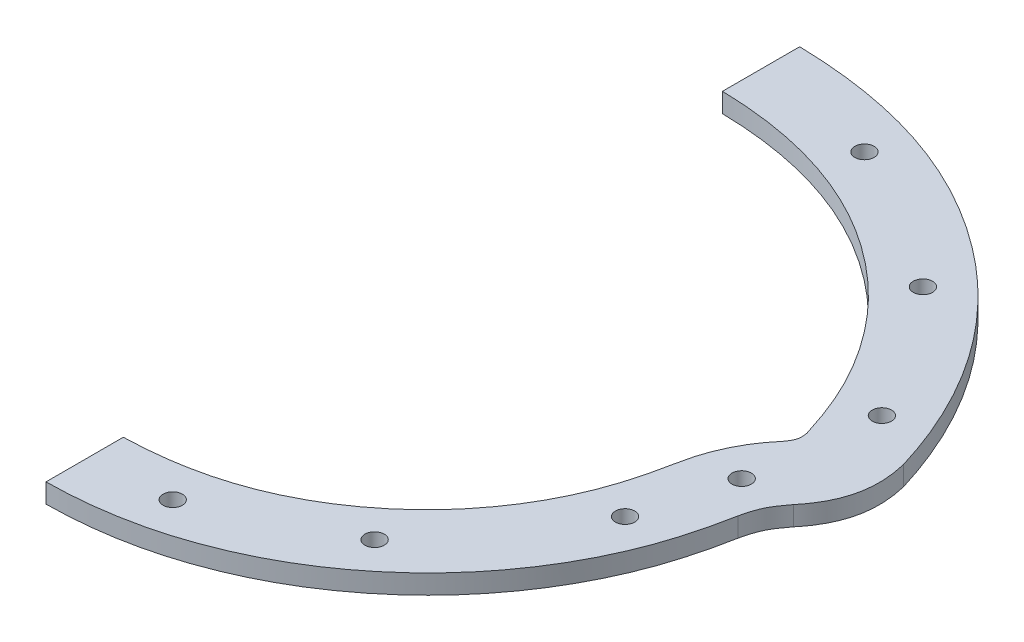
ISO-10303-21;
HEADER;
FILE_DESCRIPTION(('STEP AP214'),'2;1');
FILE_NAME('part.step','',(''),(''),'','','');
FILE_SCHEMA(('AUTOMOTIVE_DESIGN { 1 0 10303 214 1 1 1 1 }'));
ENDSEC;
DATA;
#1=APPLICATION_CONTEXT('core data for automotive mechanical design processes');
#2=APPLICATION_PROTOCOL_DEFINITION('international standard','automotive_design',2000,#1);
#3=PRODUCT_CONTEXT('',#1,'mechanical');
#4=PRODUCT('Part','Part','',(#3));
#5=PRODUCT_RELATED_PRODUCT_CATEGORY('part','',(#4));
#6=PRODUCT_DEFINITION_FORMATION('','',#4);
#7=PRODUCT_DEFINITION_CONTEXT('part definition',#1,'design');
#8=PRODUCT_DEFINITION('design','',#6,#7);
#9=PRODUCT_DEFINITION_SHAPE('','',#8);
#10=(LENGTH_UNIT() NAMED_UNIT(*) SI_UNIT(.MILLI.,.METRE.));
#11=(NAMED_UNIT(*) PLANE_ANGLE_UNIT() SI_UNIT($,.RADIAN.));
#12=(NAMED_UNIT(*) SI_UNIT($,.STERADIAN.) SOLID_ANGLE_UNIT());
#13=UNCERTAINTY_MEASURE_WITH_UNIT(LENGTH_MEASURE(1.E-05),#10,'distance_accuracy_value','');
#14=(GEOMETRIC_REPRESENTATION_CONTEXT(3) GLOBAL_UNCERTAINTY_ASSIGNED_CONTEXT((#13)) GLOBAL_UNIT_ASSIGNED_CONTEXT((#10,
#11,#12)) REPRESENTATION_CONTEXT('',''));
#15=CARTESIAN_POINT('',(0.,0.,0.));
#16=DIRECTION('',(0.,0.,1.));
#17=DIRECTION('',(1.,0.,0.));
#18=AXIS2_PLACEMENT_3D('',#15,#16,#17);
#19=CARTESIAN_POINT('',(0.,495.,175.));
#20=CARTESIAN_POINT('',(4.91742676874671,495.,174.874573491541));
#21=CARTESIAN_POINT('',(9.61803747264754,495.,174.416257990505));
#22=CARTESIAN_POINT('',(16.34372943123,495.,173.229451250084));
#23=CARTESIAN_POINT('',(18.5314227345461,495.,172.750626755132));
#24=CARTESIAN_POINT('',(21.7316566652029,495.,171.907556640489));
#25=CARTESIAN_POINT('',(22.7848503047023,495.,171.605727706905));
#26=CARTESIAN_POINT('',(24.3443142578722,495.,171.121775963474));
#27=CARTESIAN_POINT('',(24.8607478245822,495.,170.955257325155));
#28=CARTESIAN_POINT('',(25.6303165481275,495.,170.697677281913));
#29=CARTESIAN_POINT('',(25.8859925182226,495.,170.610516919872));
#30=CARTESIAN_POINT('',(26.2682360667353,495.,170.477825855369));
#31=CARTESIAN_POINT('',(26.3954388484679,495.,170.433270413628));
#32=CARTESIAN_POINT('',(26.5859254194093,495.,170.365949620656));
#33=CARTESIAN_POINT('',(26.6493680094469,495.,170.343428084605));
#34=CARTESIAN_POINT('',(26.7761473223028,495.,170.298222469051));
#35=CARTESIAN_POINT('',(26.8359975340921,495.,170.27679260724));
#36=CARTESIAN_POINT('',(31.1760670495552,495.,168.715520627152));
#37=CARTESIAN_POINT('',(35.2807350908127,495.,166.806008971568));
#38=CARTESIAN_POINT('',(41.1847903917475,495.,163.38335262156));
#39=CARTESIAN_POINT('',(43.1106510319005,495.,162.149402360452));
#40=CARTESIAN_POINT('',(45.9362053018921,495.,160.158879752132));
#41=CARTESIAN_POINT('',(46.8675172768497,495.,159.472106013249));
#42=CARTESIAN_POINT('',(48.2486760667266,495.,158.40704610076));
#43=CARTESIAN_POINT('',(48.7064274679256,495.,158.046209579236));
#44=CARTESIAN_POINT('',(49.3891022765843,495.,157.496229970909));
#45=CARTESIAN_POINT('',(49.6160018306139,495.,157.311449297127));
#46=CARTESIAN_POINT('',(50.0684835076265,495.,156.938979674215));
#47=CARTESIAN_POINT('',(50.2973023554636,495.,156.748568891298));
#48=CARTESIAN_POINT('',(54.0659759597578,495.,153.579407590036));
#49=CARTESIAN_POINT('',(57.2996815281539,495.,150.341109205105));
#50=CARTESIAN_POINT('',(61.6803178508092,495.,145.100324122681));
#51=CARTESIAN_POINT('',(63.0622096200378,495.,143.289506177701));
#52=CARTESIAN_POINT('',(64.6916739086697,495.,140.946121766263));
#53=CARTESIAN_POINT('',(65.0115890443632,495.,140.475102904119));
#54=CARTESIAN_POINT('',(65.6498058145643,495.,139.512701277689));
#55=CARTESIAN_POINT('',(65.9630231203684,495.,139.028873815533));
#56=CARTESIAN_POINT('',(66.8850017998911,495.,137.569511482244));
#57=CARTESIAN_POINT('',(67.4760899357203,495.,136.586096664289));
#58=CARTESIAN_POINT('',(69.1786613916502,495.,133.604332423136));
#59=CARTESIAN_POINT('',(70.219451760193,495.,131.574463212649));
#60=CARTESIAN_POINT('',(71.6392514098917,495.,128.466619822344));
#61=CARTESIAN_POINT('',(72.0889536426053,495.,127.420165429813));
#62=CARTESIAN_POINT('',(72.6216260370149,495.,126.098964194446));
#63=CARTESIAN_POINT('',(72.7294928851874,495.,125.826841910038));
#64=CARTESIAN_POINT('',(72.9223849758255,495.,125.33234815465));
#65=CARTESIAN_POINT('',(73.0177917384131,495.,125.083633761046));
#66=CARTESIAN_POINT('',(73.3008941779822,495.,124.333088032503));
#67=CARTESIAN_POINT('',(73.4854720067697,495.,123.826854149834));
#68=CARTESIAN_POINT('',(75.1092582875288,495.,119.217918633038));
#69=CARTESIAN_POINT('',(76.2865674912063,495.,114.745402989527));
#70=CARTESIAN_POINT('',(77.1978203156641,495.,109.897203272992));
#71=CARTESIAN_POINT('',(0.,500.,175.));
#72=CARTESIAN_POINT('',(4.91742676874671,500.,174.874573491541));
#73=CARTESIAN_POINT('',(9.61803747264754,500.,174.416257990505));
#74=CARTESIAN_POINT('',(16.34372943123,500.,173.229451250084));
#75=CARTESIAN_POINT('',(18.5314227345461,500.,172.750626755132));
#76=CARTESIAN_POINT('',(21.7316566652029,500.,171.907556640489));
#77=CARTESIAN_POINT('',(22.7848503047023,500.,171.605727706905));
#78=CARTESIAN_POINT('',(24.3443142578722,500.,171.121775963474));
#79=CARTESIAN_POINT('',(24.8607478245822,500.,170.955257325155));
#80=CARTESIAN_POINT('',(25.6303165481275,500.,170.697677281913));
#81=CARTESIAN_POINT('',(25.8859925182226,500.,170.610516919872));
#82=CARTESIAN_POINT('',(26.2682360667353,500.,170.477825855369));
#83=CARTESIAN_POINT('',(26.3954388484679,500.,170.433270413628));
#84=CARTESIAN_POINT('',(26.5859254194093,500.,170.365949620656));
#85=CARTESIAN_POINT('',(26.6493680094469,500.,170.343428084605));
#86=CARTESIAN_POINT('',(26.7761473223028,500.,170.298222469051));
#87=CARTESIAN_POINT('',(26.8359975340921,500.,170.27679260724));
#88=CARTESIAN_POINT('',(31.1760670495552,500.,168.715520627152));
#89=CARTESIAN_POINT('',(35.2807350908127,500.,166.806008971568));
#90=CARTESIAN_POINT('',(41.1847903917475,500.,163.38335262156));
#91=CARTESIAN_POINT('',(43.1106510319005,500.,162.149402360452));
#92=CARTESIAN_POINT('',(45.9362053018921,500.,160.158879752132));
#93=CARTESIAN_POINT('',(46.8675172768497,500.,159.472106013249));
#94=CARTESIAN_POINT('',(48.2486760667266,500.,158.40704610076));
#95=CARTESIAN_POINT('',(48.7064274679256,500.,158.046209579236));
#96=CARTESIAN_POINT('',(49.3891022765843,500.,157.496229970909));
#97=CARTESIAN_POINT('',(49.6160018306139,500.,157.311449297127));
#98=CARTESIAN_POINT('',(50.0684835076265,500.,156.938979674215));
#99=CARTESIAN_POINT('',(50.2973023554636,500.,156.748568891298));
#100=CARTESIAN_POINT('',(54.0659759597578,500.,153.579407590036));
#101=CARTESIAN_POINT('',(57.2996815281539,500.,150.341109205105));
#102=CARTESIAN_POINT('',(61.6803178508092,500.,145.100324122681));
#103=CARTESIAN_POINT('',(63.0622096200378,500.,143.289506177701));
#104=CARTESIAN_POINT('',(64.6916739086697,500.,140.946121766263));
#105=CARTESIAN_POINT('',(65.0115890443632,500.,140.475102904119));
#106=CARTESIAN_POINT('',(65.6498058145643,500.,139.512701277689));
#107=CARTESIAN_POINT('',(65.9630231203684,500.,139.028873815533));
#108=CARTESIAN_POINT('',(66.8850017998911,500.,137.569511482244));
#109=CARTESIAN_POINT('',(67.4760899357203,500.,136.586096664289));
#110=CARTESIAN_POINT('',(69.1786613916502,500.,133.604332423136));
#111=CARTESIAN_POINT('',(70.219451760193,500.,131.574463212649));
#112=CARTESIAN_POINT('',(71.6392514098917,500.,128.466619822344));
#113=CARTESIAN_POINT('',(72.0889536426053,500.,127.420165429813));
#114=CARTESIAN_POINT('',(72.6216260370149,500.,126.098964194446));
#115=CARTESIAN_POINT('',(72.7294928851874,500.,125.826841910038));
#116=CARTESIAN_POINT('',(72.9223849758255,500.,125.33234815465));
#117=CARTESIAN_POINT('',(73.0177917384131,500.,125.083633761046));
#118=CARTESIAN_POINT('',(73.3008941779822,500.,124.333088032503));
#119=CARTESIAN_POINT('',(73.4854720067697,500.,123.826854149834));
#120=CARTESIAN_POINT('',(75.1092582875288,500.,119.217918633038));
#121=CARTESIAN_POINT('',(76.2865674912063,500.,114.745402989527));
#122=CARTESIAN_POINT('',(77.1978203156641,500.,109.897203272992));
#123=B_SPLINE_SURFACE_WITH_KNOTS('',1,3,((#19,#20,#21,#22,#23,#24,#25,#26,#27,#28,#29,#30,#31,
#32,#33,#34,#35,#36,#37,#38,#39,#40,#41,#42,#43,#44,#45,#46,#47,#48,#49,#50,#51,#52,#53,#54,#55,
#56,#57,#58,#59,#60,#61,#62,#63,#64,#65,#66,#67,#68,#69,#70),(#71,#72,#73,#74,#75,#76,#77,#78,
#79,#80,#81,#82,#83,#84,#85,#86,#87,#88,#89,#90,#91,#92,#93,#94,#95,#96,#97,#98,#99,#100,#101,
#102,#103,#104,#105,#106,#107,#108,#109,#110,#111,#112,#113,#114,#115,#116,#117,#118,#119,#120,
#121,#122)),.UNSPECIFIED.,.F.,.F.,.F.,(2,2),(4,2,2,2,2,2,2,2,2,2,2,2,2,2,2,2,2,2,2,2,2,2,2,2,2,
4),(0.,1.),(0.,0.125,0.1875,0.21875,0.234375,0.2421875,0.24609375,0.248046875,0.25,0.375,0.4375,
0.46875,0.484375,0.4921875,0.5,0.625,0.6875,0.703125,0.71875,0.75,0.8125,0.84375,0.8515625,
0.859375,0.875,1.),.UNSPECIFIED.);
#124=DIRECTION('',(0.,-1.,0.));
#125=VECTOR('',#124,1.);
#126=CARTESIAN_POINT('',(0.,495.,175.));
#127=LINE('',#126,#125);
#128=CARTESIAN_POINT('',(0.,500.,175.));
#129=VERTEX_POINT('',#128);
#130=CARTESIAN_POINT('',(0.,495.,175.));
#131=VERTEX_POINT('',#130);
#132=EDGE_CURVE('E12',#129,#131,#127,.T.);
#133=CARTESIAN_POINT('',(0.,500.,175.));
#134=CARTESIAN_POINT('',(4.91742676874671,500.,174.874573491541));
#135=CARTESIAN_POINT('',(9.61803747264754,500.,174.416257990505));
#136=CARTESIAN_POINT('',(16.34372943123,500.,173.229451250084));
#137=CARTESIAN_POINT('',(18.5314227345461,500.,172.750626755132));
#138=CARTESIAN_POINT('',(21.7316566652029,500.,171.907556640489));
#139=CARTESIAN_POINT('',(22.7848503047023,500.,171.605727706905));
#140=CARTESIAN_POINT('',(24.3443142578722,500.,171.121775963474));
#141=CARTESIAN_POINT('',(24.8607478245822,500.,170.955257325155));
#142=CARTESIAN_POINT('',(25.6303165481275,500.,170.697677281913));
#143=CARTESIAN_POINT('',(25.8859925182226,500.,170.610516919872));
#144=CARTESIAN_POINT('',(26.2682360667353,500.,170.477825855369));
#145=CARTESIAN_POINT('',(26.3954388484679,500.,170.433270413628));
#146=CARTESIAN_POINT('',(26.5859254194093,500.,170.365949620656));
#147=CARTESIAN_POINT('',(26.6493680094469,500.,170.343428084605));
#148=CARTESIAN_POINT('',(26.7761473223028,500.,170.298222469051));
#149=CARTESIAN_POINT('',(26.8359975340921,500.,170.27679260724));
#150=CARTESIAN_POINT('',(31.1760670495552,500.,168.715520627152));
#151=CARTESIAN_POINT('',(35.2807350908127,500.,166.806008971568));
#152=CARTESIAN_POINT('',(41.1847903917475,500.,163.38335262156));
#153=CARTESIAN_POINT('',(43.1106510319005,500.,162.149402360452));
#154=CARTESIAN_POINT('',(45.9362053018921,500.,160.158879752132));
#155=CARTESIAN_POINT('',(46.8675172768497,500.,159.472106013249));
#156=CARTESIAN_POINT('',(48.2486760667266,500.,158.40704610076));
#157=CARTESIAN_POINT('',(48.7064274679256,500.,158.046209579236));
#158=CARTESIAN_POINT('',(49.3891022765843,500.,157.496229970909));
#159=CARTESIAN_POINT('',(49.6160018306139,500.,157.311449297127));
#160=CARTESIAN_POINT('',(50.0684835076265,500.,156.938979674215));
#161=CARTESIAN_POINT('',(50.2973023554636,500.,156.748568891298));
#162=CARTESIAN_POINT('',(54.0659759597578,500.,153.579407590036));
#163=CARTESIAN_POINT('',(57.2996815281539,500.,150.341109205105));
#164=CARTESIAN_POINT('',(61.6803178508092,500.,145.100324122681));
#165=CARTESIAN_POINT('',(63.0622096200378,500.,143.289506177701));
#166=CARTESIAN_POINT('',(64.6916739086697,500.,140.946121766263));
#167=CARTESIAN_POINT('',(65.0115890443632,500.,140.475102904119));
#168=CARTESIAN_POINT('',(65.6498058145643,500.,139.512701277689));
#169=CARTESIAN_POINT('',(65.9630231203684,500.,139.028873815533));
#170=CARTESIAN_POINT('',(66.8850017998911,500.,137.569511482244));
#171=CARTESIAN_POINT('',(67.4760899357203,500.,136.586096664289));
#172=CARTESIAN_POINT('',(69.1786613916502,500.,133.604332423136));
#173=CARTESIAN_POINT('',(70.219451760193,500.,131.574463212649));
#174=CARTESIAN_POINT('',(71.6392514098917,500.,128.466619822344));
#175=CARTESIAN_POINT('',(72.0889536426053,500.,127.420165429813));
#176=CARTESIAN_POINT('',(72.6216260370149,500.,126.098964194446));
#177=CARTESIAN_POINT('',(72.7294928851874,500.,125.826841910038));
#178=CARTESIAN_POINT('',(72.9223849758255,500.,125.33234815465));
#179=CARTESIAN_POINT('',(73.0177917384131,500.,125.083633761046));
#180=CARTESIAN_POINT('',(73.3008941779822,500.,124.333088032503));
#181=CARTESIAN_POINT('',(73.4854720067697,500.,123.826854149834));
#182=CARTESIAN_POINT('',(75.1092582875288,500.,119.217918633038));
#183=CARTESIAN_POINT('',(76.2865674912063,500.,114.745402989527));
#184=CARTESIAN_POINT('',(77.1978203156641,500.,109.897203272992));
#185=B_SPLINE_CURVE_WITH_KNOTS('',3,(#133,#134,#135,#136,#137,#138,#139,#140,#141,#142,#143,
#144,#145,#146,#147,#148,#149,#150,#151,#152,#153,#154,#155,#156,#157,#158,#159,#160,#161,#162,
#163,#164,#165,#166,#167,#168,#169,#170,#171,#172,#173,#174,#175,#176,#177,#178,#179,#180,#181,
#182,#183,#184),.UNSPECIFIED.,.F.,.F.,(4,2,2,2,2,2,2,2,2,2,2,2,2,2,2,2,2,2,2,2,2,2,2,2,2,4),(0.,
0.125,0.1875,0.21875,0.234375,0.2421875,0.24609375,0.248046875,0.25,0.375,0.4375,0.46875,
0.484375,0.4921875,0.5,0.625,0.6875,0.703125,0.71875,0.75,0.8125,0.84375,0.8515625,0.859375,
0.875,1.),.UNSPECIFIED.);
#186=CARTESIAN_POINT('',(77.1978203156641,500.,109.897203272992));
#187=VERTEX_POINT('',#186);
#188=EDGE_CURVE('E280',#129,#187,#185,.T.);
#189=CARTESIAN_POINT('',(77.1978203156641,500.,109.897203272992));
#190=CARTESIAN_POINT('',(77.1978203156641,495.,109.897203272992));
#191=B_SPLINE_CURVE_WITH_KNOTS('',1,(#189,#190),.UNSPECIFIED.,.F.,.F.,(2,2),(0.,1.),.UNSPECIFIED.);
#192=CARTESIAN_POINT('',(77.1978203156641,495.,109.897203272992));
#193=VERTEX_POINT('',#192);
#194=EDGE_CURVE('E234',#187,#193,#191,.T.);
#195=CARTESIAN_POINT('',(77.1978203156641,495.,109.897203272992));
#196=CARTESIAN_POINT('',(76.2865674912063,495.,114.745402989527));
#197=CARTESIAN_POINT('',(75.1092582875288,495.,119.217918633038));
#198=CARTESIAN_POINT('',(73.4854720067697,495.,123.826854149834));
#199=CARTESIAN_POINT('',(73.3008941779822,495.,124.333088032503));
#200=CARTESIAN_POINT('',(73.0177917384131,495.,125.083633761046));
#201=CARTESIAN_POINT('',(72.9223849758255,495.,125.33234815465));
#202=CARTESIAN_POINT('',(72.7294928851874,495.,125.826841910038));
#203=CARTESIAN_POINT('',(72.6216260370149,495.,126.098964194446));
#204=CARTESIAN_POINT('',(72.0889536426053,495.,127.420165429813));
#205=CARTESIAN_POINT('',(71.6392514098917,495.,128.466619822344));
#206=CARTESIAN_POINT('',(70.219451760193,495.,131.574463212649));
#207=CARTESIAN_POINT('',(69.1786613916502,495.,133.604332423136));
#208=CARTESIAN_POINT('',(67.4760899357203,495.,136.586096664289));
#209=CARTESIAN_POINT('',(66.8850017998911,495.,137.569511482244));
#210=CARTESIAN_POINT('',(65.9630231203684,495.,139.028873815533));
#211=CARTESIAN_POINT('',(65.6498058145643,495.,139.512701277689));
#212=CARTESIAN_POINT('',(65.0115890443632,495.,140.475102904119));
#213=CARTESIAN_POINT('',(64.6916739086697,495.,140.946121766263));
#214=CARTESIAN_POINT('',(63.0622096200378,495.,143.289506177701));
#215=CARTESIAN_POINT('',(61.6803178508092,495.,145.100324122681));
#216=CARTESIAN_POINT('',(57.2996815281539,495.,150.341109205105));
#217=CARTESIAN_POINT('',(54.0659759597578,495.,153.579407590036));
#218=CARTESIAN_POINT('',(50.2973023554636,495.,156.748568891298));
#219=CARTESIAN_POINT('',(50.0684835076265,495.,156.938979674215));
#220=CARTESIAN_POINT('',(49.6160018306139,495.,157.311449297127));
#221=CARTESIAN_POINT('',(49.3891022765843,495.,157.496229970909));
#222=CARTESIAN_POINT('',(48.7064274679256,495.,158.046209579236));
#223=CARTESIAN_POINT('',(48.2486760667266,495.,158.40704610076));
#224=CARTESIAN_POINT('',(46.8675172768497,495.,159.472106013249));
#225=CARTESIAN_POINT('',(45.9362053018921,495.,160.158879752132));
#226=CARTESIAN_POINT('',(43.1106510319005,495.,162.149402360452));
#227=CARTESIAN_POINT('',(41.1847903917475,495.,163.38335262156));
#228=CARTESIAN_POINT('',(35.2807350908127,495.,166.806008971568));
#229=CARTESIAN_POINT('',(31.1760670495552,495.,168.715520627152));
#230=CARTESIAN_POINT('',(26.8359975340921,495.,170.27679260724));
#231=CARTESIAN_POINT('',(26.7761473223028,495.,170.298222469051));
#232=CARTESIAN_POINT('',(26.6493680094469,495.,170.343428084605));
#233=CARTESIAN_POINT('',(26.5859254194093,495.,170.365949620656));
#234=CARTESIAN_POINT('',(26.3954388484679,495.,170.433270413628));
#235=CARTESIAN_POINT('',(26.2682360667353,495.,170.477825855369));
#236=CARTESIAN_POINT('',(25.8859925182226,495.,170.610516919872));
#237=CARTESIAN_POINT('',(25.6303165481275,495.,170.697677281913));
#238=CARTESIAN_POINT('',(24.8607478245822,495.,170.955257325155));
#239=CARTESIAN_POINT('',(24.3443142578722,495.,171.121775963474));
#240=CARTESIAN_POINT('',(22.7848503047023,495.,171.605727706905));
#241=CARTESIAN_POINT('',(21.7316566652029,495.,171.907556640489));
#242=CARTESIAN_POINT('',(18.5314227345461,495.,172.750626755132));
#243=CARTESIAN_POINT('',(16.34372943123,495.,173.229451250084));
#244=CARTESIAN_POINT('',(9.61803747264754,495.,174.416257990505));
#245=CARTESIAN_POINT('',(4.91742676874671,495.,174.874573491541));
#246=CARTESIAN_POINT('',(0.,495.,175.));
#247=B_SPLINE_CURVE_WITH_KNOTS('',3,(#195,#196,#197,#198,#199,#200,#201,#202,#203,#204,#205,
#206,#207,#208,#209,#210,#211,#212,#213,#214,#215,#216,#217,#218,#219,#220,#221,#222,#223,#224,
#225,#226,#227,#228,#229,#230,#231,#232,#233,#234,#235,#236,#237,#238,#239,#240,#241,#242,#243,
#244,#245,#246),.UNSPECIFIED.,.F.,.F.,(4,2,2,2,2,2,2,2,2,2,2,2,2,2,2,2,2,2,2,2,2,2,2,2,2,4),(0.,
0.125,0.140625,0.1484375,0.15625,0.1875,0.25,0.28125,0.296875,0.3125,0.375,0.5,0.5078125,
0.515625,0.53125,0.5625,0.625,0.75,0.751953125,0.75390625,0.7578125,0.765625,0.78125,0.8125,
0.875,1.),.UNSPECIFIED.);
#248=EDGE_CURVE('E284',#131,#193,#247,.F.);
#249=ORIENTED_EDGE('',*,*,#132,.F.);
#250=ORIENTED_EDGE('',*,*,#188,.T.);
#251=ORIENTED_EDGE('',*,*,#194,.T.);
#252=ORIENTED_EDGE('',*,*,#248,.F.);
#253=EDGE_LOOP('',(#249,#250,#251,#252));
#254=FACE_BOUND('',#253,.T.);
#255=ADVANCED_FACE('F223',(#254),#123,.T.);
#256=CARTESIAN_POINT('',(77.1978203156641,495.,109.897203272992));
#257=CARTESIAN_POINT('',(77.4401659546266,495.,108.729151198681));
#258=CARTESIAN_POINT('',(77.6693714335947,495.,107.699901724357));
#259=CARTESIAN_POINT('',(77.9934694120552,495.,106.36423141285));
#260=CARTESIAN_POINT('',(78.0982170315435,495.,105.953708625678));
#261=CARTESIAN_POINT('',(78.2504109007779,495.,105.389975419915));
#262=CARTESIAN_POINT('',(78.300320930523,495.,105.210739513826));
#263=CARTESIAN_POINT('',(78.3739540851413,495.,104.954898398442));
#264=CARTESIAN_POINT('',(78.3982931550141,495.,104.871786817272));
#265=CARTESIAN_POINT('',(78.4344937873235,495.,104.750372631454));
#266=CARTESIAN_POINT('',(78.44650933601,495.,104.710443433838));
#267=CARTESIAN_POINT('',(78.4644556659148,495.,104.651362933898));
#268=CARTESIAN_POINT('',(78.4704249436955,495.,104.631804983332));
#269=CARTESIAN_POINT('',(78.4793596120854,495.,104.602671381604));
#270=CARTESIAN_POINT('',(78.4823346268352,495.,104.592994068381));
#271=CARTESIAN_POINT('',(78.488278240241,495.,104.573707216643));
#272=CARTESIAN_POINT('',(78.490072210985,495.,104.567890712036));
#273=CARTESIAN_POINT('',(78.7591734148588,495.,103.698926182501));
#274=CARTESIAN_POINT('',(79.0580805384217,495.,102.844448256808));
#275=CARTESIAN_POINT('',(79.723786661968,495.,101.137728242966));
#276=CARTESIAN_POINT('',(80.0919262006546,495.,100.282639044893));
#277=CARTESIAN_POINT('',(80.890734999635,495.,98.5860849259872));
#278=CARTESIAN_POINT('',(81.3138374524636,495.,97.7621631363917));
#279=CARTESIAN_POINT('',(81.984038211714,495.,96.5628133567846));
#280=CARTESIAN_POINT('',(82.2133629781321,495.,96.16911891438));
#281=CARTESIAN_POINT('',(82.566236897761,495.,95.5877104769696));
#282=CARTESIAN_POINT('',(82.685342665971,495.,95.3954298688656));
#283=CARTESIAN_POINT('',(82.8662230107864,495.,95.1092922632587));
#284=CARTESIAN_POINT('',(82.9268867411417,495.,95.0142936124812));
#285=CARTESIAN_POINT('',(83.0184377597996,495.,94.8723664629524));
#286=CARTESIAN_POINT('',(83.0490473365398,495.,94.8251525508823));
#287=CARTESIAN_POINT('',(83.0951005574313,495.,94.7544743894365));
#288=CARTESIAN_POINT('',(83.110474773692,495.,94.7309387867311));
#289=CARTESIAN_POINT('',(83.1335708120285,495.,94.6956710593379));
#290=CARTESIAN_POINT('',(83.1412752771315,495.,94.6839210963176));
#291=CARTESIAN_POINT('',(83.1566957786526,495.,94.6604330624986));
#292=CARTESIAN_POINT('',(83.1667328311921,495.,94.6451685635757));
#293=CARTESIAN_POINT('',(83.8634367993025,495.,93.586633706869));
#294=CARTESIAN_POINT('',(84.9700243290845,495.,92.1260075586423));
#295=CARTESIAN_POINT('',(86.4918962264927,495.,90.2550844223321));
#296=CARTESIAN_POINT('',(77.1978203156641,500.,109.897203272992));
#297=CARTESIAN_POINT('',(77.4401659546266,500.,108.729151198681));
#298=CARTESIAN_POINT('',(77.6693714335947,500.,107.699901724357));
#299=CARTESIAN_POINT('',(77.9934694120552,500.,106.36423141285));
#300=CARTESIAN_POINT('',(78.0982170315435,500.,105.953708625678));
#301=CARTESIAN_POINT('',(78.2504109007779,500.,105.389975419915));
#302=CARTESIAN_POINT('',(78.300320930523,500.,105.210739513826));
#303=CARTESIAN_POINT('',(78.3739540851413,500.,104.954898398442));
#304=CARTESIAN_POINT('',(78.3982931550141,500.,104.871786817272));
#305=CARTESIAN_POINT('',(78.4344937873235,500.,104.750372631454));
#306=CARTESIAN_POINT('',(78.44650933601,500.,104.710443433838));
#307=CARTESIAN_POINT('',(78.4644556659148,500.,104.651362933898));
#308=CARTESIAN_POINT('',(78.4704249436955,500.,104.631804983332));
#309=CARTESIAN_POINT('',(78.4793596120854,500.,104.602671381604));
#310=CARTESIAN_POINT('',(78.4823346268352,500.,104.592994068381));
#311=CARTESIAN_POINT('',(78.488278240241,500.,104.573707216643));
#312=CARTESIAN_POINT('',(78.490072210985,500.,104.567890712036));
#313=CARTESIAN_POINT('',(78.7591734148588,500.,103.698926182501));
#314=CARTESIAN_POINT('',(79.0580805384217,500.,102.844448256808));
#315=CARTESIAN_POINT('',(79.723786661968,500.,101.137728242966));
#316=CARTESIAN_POINT('',(80.0919262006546,500.,100.282639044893));
#317=CARTESIAN_POINT('',(80.890734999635,500.,98.5860849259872));
#318=CARTESIAN_POINT('',(81.3138374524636,500.,97.7621631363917));
#319=CARTESIAN_POINT('',(81.984038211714,500.,96.5628133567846));
#320=CARTESIAN_POINT('',(82.2133629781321,500.,96.16911891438));
#321=CARTESIAN_POINT('',(82.566236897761,500.,95.5877104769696));
#322=CARTESIAN_POINT('',(82.685342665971,500.,95.3954298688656));
#323=CARTESIAN_POINT('',(82.8662230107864,500.,95.1092922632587));
#324=CARTESIAN_POINT('',(82.9268867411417,500.,95.0142936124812));
#325=CARTESIAN_POINT('',(83.0184377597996,500.,94.8723664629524));
#326=CARTESIAN_POINT('',(83.0490473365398,500.,94.8251525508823));
#327=CARTESIAN_POINT('',(83.0951005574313,500.,94.7544743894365));
#328=CARTESIAN_POINT('',(83.110474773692,500.,94.7309387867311));
#329=CARTESIAN_POINT('',(83.1335708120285,500.,94.6956710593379));
#330=CARTESIAN_POINT('',(83.1412752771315,500.,94.6839210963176));
#331=CARTESIAN_POINT('',(83.1566957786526,500.,94.6604330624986));
#332=CARTESIAN_POINT('',(83.1667328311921,500.,94.6451685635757));
#333=CARTESIAN_POINT('',(83.8634367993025,500.,93.586633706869));
#334=CARTESIAN_POINT('',(84.9700243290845,500.,92.1260075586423));
#335=CARTESIAN_POINT('',(86.4918962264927,500.,90.2550844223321));
#336=B_SPLINE_SURFACE_WITH_KNOTS('',1,3,((#256,#257,#258,#259,#260,#261,#262,#263,#264,#265,
#266,#267,#268,#269,#270,#271,#272,#273,#274,#275,#276,#277,#278,#279,#280,#281,#282,#283,#284,
#285,#286,#287,#288,#289,#290,#291,#292,#293,#294,#295),(#296,#297,#298,#299,#300,#301,#302,
#303,#304,#305,#306,#307,#308,#309,#310,#311,#312,#313,#314,#315,#316,#317,#318,#319,#320,#321,
#322,#323,#324,#325,#326,#327,#328,#329,#330,#331,#332,#333,#334,#335)),.UNSPECIFIED.,.F.,.F.,
.F.,(2,2),(4,2,2,2,2,2,2,2,2,2,2,2,2,2,2,2,2,2,2,4),(0.,1.),(0.,0.125,0.1875,0.21875,0.234375,
0.2421875,0.24609375,0.248046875,0.25,0.375,0.5,0.625,0.6875,0.71875,0.734375,0.7421875,
0.74609375,0.748046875,0.75,1.),.UNSPECIFIED.);
#337=CARTESIAN_POINT('',(77.1978203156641,500.,109.897203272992));
#338=CARTESIAN_POINT('',(77.4401659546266,500.,108.729151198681));
#339=CARTESIAN_POINT('',(77.6693714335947,500.,107.699901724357));
#340=CARTESIAN_POINT('',(77.9934694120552,500.,106.36423141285));
#341=CARTESIAN_POINT('',(78.0982170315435,500.,105.953708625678));
#342=CARTESIAN_POINT('',(78.2504109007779,500.,105.389975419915));
#343=CARTESIAN_POINT('',(78.300320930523,500.,105.210739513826));
#344=CARTESIAN_POINT('',(78.3739540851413,500.,104.954898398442));
#345=CARTESIAN_POINT('',(78.3982931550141,500.,104.871786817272));
#346=CARTESIAN_POINT('',(78.4344937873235,500.,104.750372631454));
#347=CARTESIAN_POINT('',(78.44650933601,500.,104.710443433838));
#348=CARTESIAN_POINT('',(78.4644556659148,500.,104.651362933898));
#349=CARTESIAN_POINT('',(78.4704249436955,500.,104.631804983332));
#350=CARTESIAN_POINT('',(78.4793596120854,500.,104.602671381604));
#351=CARTESIAN_POINT('',(78.4823346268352,500.,104.592994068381));
#352=CARTESIAN_POINT('',(78.488278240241,500.,104.573707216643));
#353=CARTESIAN_POINT('',(78.490072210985,500.,104.567890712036));
#354=CARTESIAN_POINT('',(78.7591734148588,500.,103.698926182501));
#355=CARTESIAN_POINT('',(79.0580805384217,500.,102.844448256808));
#356=CARTESIAN_POINT('',(79.723786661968,500.,101.137728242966));
#357=CARTESIAN_POINT('',(80.0919262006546,500.,100.282639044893));
#358=CARTESIAN_POINT('',(80.890734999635,500.,98.5860849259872));
#359=CARTESIAN_POINT('',(81.3138374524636,500.,97.7621631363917));
#360=CARTESIAN_POINT('',(81.984038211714,500.,96.5628133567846));
#361=CARTESIAN_POINT('',(82.2133629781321,500.,96.16911891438));
#362=CARTESIAN_POINT('',(82.566236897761,500.,95.5877104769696));
#363=CARTESIAN_POINT('',(82.685342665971,500.,95.3954298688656));
#364=CARTESIAN_POINT('',(82.8662230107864,500.,95.1092922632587));
#365=CARTESIAN_POINT('',(82.9268867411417,500.,95.0142936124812));
#366=CARTESIAN_POINT('',(83.0184377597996,500.,94.8723664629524));
#367=CARTESIAN_POINT('',(83.0490473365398,500.,94.8251525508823));
#368=CARTESIAN_POINT('',(83.0951005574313,500.,94.7544743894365));
#369=CARTESIAN_POINT('',(83.110474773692,500.,94.7309387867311));
#370=CARTESIAN_POINT('',(83.1335708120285,500.,94.6956710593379));
#371=CARTESIAN_POINT('',(83.1412752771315,500.,94.6839210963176));
#372=CARTESIAN_POINT('',(83.1566957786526,500.,94.6604330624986));
#373=CARTESIAN_POINT('',(83.1667328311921,500.,94.6451685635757));
#374=CARTESIAN_POINT('',(83.8634367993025,500.,93.586633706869));
#375=CARTESIAN_POINT('',(84.9700243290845,500.,92.1260075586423));
#376=CARTESIAN_POINT('',(86.4918962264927,500.,90.2550844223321));
#377=B_SPLINE_CURVE_WITH_KNOTS('',3,(#337,#338,#339,#340,#341,#342,#343,#344,#345,#346,#347,
#348,#349,#350,#351,#352,#353,#354,#355,#356,#357,#358,#359,#360,#361,#362,#363,#364,#365,#366,
#367,#368,#369,#370,#371,#372,#373,#374,#375,#376),.UNSPECIFIED.,.F.,.F.,(4,2,2,2,2,2,2,2,2,2,2,
2,2,2,2,2,2,2,2,4),(0.,0.125,0.1875,0.21875,0.234375,0.2421875,0.24609375,0.248046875,0.25,
0.375,0.5,0.625,0.6875,0.71875,0.734375,0.7421875,0.74609375,0.748046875,0.75,1.),.UNSPECIFIED.);
#378=CARTESIAN_POINT('',(86.4918962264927,500.,90.2550844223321));
#379=VERTEX_POINT('',#378);
#380=EDGE_CURVE('E300',#187,#379,#377,.T.);
#381=DIRECTION('',(0.,-1.,0.));
#382=VECTOR('',#381,1.);
#383=CARTESIAN_POINT('',(86.4918962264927,497.5,90.2550844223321));
#384=LINE('',#383,#382);
#385=CARTESIAN_POINT('',(86.4918962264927,495.,90.2550844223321));
#386=VERTEX_POINT('',#385);
#387=EDGE_CURVE('E562',#379,#386,#384,.T.);
#388=CARTESIAN_POINT('',(86.4918962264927,495.,90.2550844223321));
#389=CARTESIAN_POINT('',(84.9700243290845,495.,92.1260075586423));
#390=CARTESIAN_POINT('',(83.8634367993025,495.,93.586633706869));
#391=CARTESIAN_POINT('',(83.1667328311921,495.,94.6451685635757));
#392=CARTESIAN_POINT('',(83.1566957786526,495.,94.6604330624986));
#393=CARTESIAN_POINT('',(83.1412752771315,495.,94.6839210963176));
#394=CARTESIAN_POINT('',(83.1335708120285,495.,94.6956710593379));
#395=CARTESIAN_POINT('',(83.110474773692,495.,94.7309387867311));
#396=CARTESIAN_POINT('',(83.0951005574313,495.,94.7544743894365));
#397=CARTESIAN_POINT('',(83.0490473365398,495.,94.8251525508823));
#398=CARTESIAN_POINT('',(83.0184377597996,495.,94.8723664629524));
#399=CARTESIAN_POINT('',(82.9268867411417,495.,95.0142936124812));
#400=CARTESIAN_POINT('',(82.8662230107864,495.,95.1092922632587));
#401=CARTESIAN_POINT('',(82.685342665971,495.,95.3954298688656));
#402=CARTESIAN_POINT('',(82.566236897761,495.,95.5877104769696));
#403=CARTESIAN_POINT('',(82.2133629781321,495.,96.16911891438));
#404=CARTESIAN_POINT('',(81.984038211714,495.,96.5628133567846));
#405=CARTESIAN_POINT('',(81.3138374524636,495.,97.7621631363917));
#406=CARTESIAN_POINT('',(80.890734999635,495.,98.5860849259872));
#407=CARTESIAN_POINT('',(80.0919262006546,495.,100.282639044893));
#408=CARTESIAN_POINT('',(79.723786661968,495.,101.137728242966));
#409=CARTESIAN_POINT('',(79.0580805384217,495.,102.844448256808));
#410=CARTESIAN_POINT('',(78.7591734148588,495.,103.698926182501));
#411=CARTESIAN_POINT('',(78.490072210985,495.,104.567890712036));
#412=CARTESIAN_POINT('',(78.488278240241,495.,104.573707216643));
#413=CARTESIAN_POINT('',(78.4823346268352,495.,104.592994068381));
#414=CARTESIAN_POINT('',(78.4793596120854,495.,104.602671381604));
#415=CARTESIAN_POINT('',(78.4704249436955,495.,104.631804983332));
#416=CARTESIAN_POINT('',(78.4644556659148,495.,104.651362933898));
#417=CARTESIAN_POINT('',(78.44650933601,495.,104.710443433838));
#418=CARTESIAN_POINT('',(78.4344937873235,495.,104.750372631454));
#419=CARTESIAN_POINT('',(78.3982931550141,495.,104.871786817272));
#420=CARTESIAN_POINT('',(78.3739540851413,495.,104.954898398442));
#421=CARTESIAN_POINT('',(78.300320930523,495.,105.210739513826));
#422=CARTESIAN_POINT('',(78.2504109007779,495.,105.389975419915));
#423=CARTESIAN_POINT('',(78.0982170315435,495.,105.953708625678));
#424=CARTESIAN_POINT('',(77.9934694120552,495.,106.36423141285));
#425=CARTESIAN_POINT('',(77.6693714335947,495.,107.699901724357));
#426=CARTESIAN_POINT('',(77.4401659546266,495.,108.729151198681));
#427=CARTESIAN_POINT('',(77.1978203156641,495.,109.897203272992));
#428=B_SPLINE_CURVE_WITH_KNOTS('',3,(#388,#389,#390,#391,#392,#393,#394,#395,#396,#397,#398,
#399,#400,#401,#402,#403,#404,#405,#406,#407,#408,#409,#410,#411,#412,#413,#414,#415,#416,#417,
#418,#419,#420,#421,#422,#423,#424,#425,#426,#427),.UNSPECIFIED.,.F.,.F.,(4,2,2,2,2,2,2,2,2,2,2,
2,2,2,2,2,2,2,2,4),(0.,0.25,0.251953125,0.25390625,0.2578125,0.265625,0.28125,0.3125,0.375,0.5,
0.625,0.75,0.751953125,0.75390625,0.7578125,0.765625,0.78125,0.8125,0.875,1.),.UNSPECIFIED.);
#429=EDGE_CURVE('E477',#193,#386,#428,.F.);
#430=ORIENTED_EDGE('',*,*,#194,.F.);
#431=ORIENTED_EDGE('',*,*,#380,.T.);
#432=ORIENTED_EDGE('',*,*,#387,.T.);
#433=ORIENTED_EDGE('',*,*,#429,.F.);
#434=EDGE_LOOP('',(#430,#431,#432,#433));
#435=FACE_BOUND('',#434,.T.);
#436=ADVANCED_FACE('F582',(#435),#336,.T.);
#437=CARTESIAN_POINT('',(86.4918962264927,495.,90.2550844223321));
#438=CARTESIAN_POINT('',(86.7915298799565,495.,89.8271488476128));
#439=CARTESIAN_POINT('',(87.0334002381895,495.,89.4320940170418));
#440=CARTESIAN_POINT('',(87.3095608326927,495.,88.8888328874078));
#441=CARTESIAN_POINT('',(87.387173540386,495.,88.7159660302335));
#442=CARTESIAN_POINT('',(87.5135173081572,495.,88.386672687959));
#443=CARTESIAN_POINT('',(87.5615626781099,495.,88.233209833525));
#444=CARTESIAN_POINT('',(87.7364423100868,495.,87.4773601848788));
#445=CARTESIAN_POINT('',(87.7146131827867,495.,86.6656998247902));
#446=CARTESIAN_POINT('',(87.5310512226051,495.,85.6470588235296));
#447=CARTESIAN_POINT('',(86.4918962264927,500.,90.2550844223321));
#448=CARTESIAN_POINT('',(86.7915298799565,500.,89.8271488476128));
#449=CARTESIAN_POINT('',(87.0334002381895,500.,89.4320940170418));
#450=CARTESIAN_POINT('',(87.3095608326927,500.,88.8888328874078));
#451=CARTESIAN_POINT('',(87.387173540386,500.,88.7159660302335));
#452=CARTESIAN_POINT('',(87.5135173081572,500.,88.386672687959));
#453=CARTESIAN_POINT('',(87.5615626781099,500.,88.233209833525));
#454=CARTESIAN_POINT('',(87.7364423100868,500.,87.4773601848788));
#455=CARTESIAN_POINT('',(87.7146131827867,500.,86.6656998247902));
#456=CARTESIAN_POINT('',(87.5310512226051,500.,85.6470588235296));
#457=B_SPLINE_SURFACE_WITH_KNOTS('',1,3,((#437,#438,#439,#440,#441,#442,#443,#444,#445,#446),
(#447,#448,#449,#450,#451,#452,#453,#454,#455,#456)),.UNSPECIFIED.,.F.,.F.,.F.,(2,2),(4,2,2,2,
4),(0.,1.),(0.,0.25,0.375,0.5,1.),.UNSPECIFIED.);
#458=CARTESIAN_POINT('',(86.4918962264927,500.,90.2550844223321));
#459=CARTESIAN_POINT('',(86.7915298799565,500.,89.8271488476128));
#460=CARTESIAN_POINT('',(87.0334002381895,500.,89.4320940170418));
#461=CARTESIAN_POINT('',(87.3095608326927,500.,88.8888328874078));
#462=CARTESIAN_POINT('',(87.387173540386,500.,88.7159660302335));
#463=CARTESIAN_POINT('',(87.5135173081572,500.,88.386672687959));
#464=CARTESIAN_POINT('',(87.5615626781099,500.,88.233209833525));
#465=CARTESIAN_POINT('',(87.7364423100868,500.,87.4773601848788));
#466=CARTESIAN_POINT('',(87.7146131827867,500.,86.6656998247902));
#467=CARTESIAN_POINT('',(87.5310512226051,500.,85.6470588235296));
#468=B_SPLINE_CURVE_WITH_KNOTS('',3,(#458,#459,#460,#461,#462,#463,#464,#465,#466,#467),
.UNSPECIFIED.,.F.,.F.,(4,2,2,2,4),(0.,0.25,0.375,0.5,1.),.UNSPECIFIED.);
#469=CARTESIAN_POINT('',(87.5310512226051,500.,85.6470588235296));
#470=VERTEX_POINT('',#469);
#471=EDGE_CURVE('E690',#379,#470,#468,.T.);
#472=DIRECTION('',(0.,-1.,0.));
#473=VECTOR('',#472,1.);
#474=CARTESIAN_POINT('',(87.5310512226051,497.5,85.6470588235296));
#475=LINE('',#474,#473);
#476=CARTESIAN_POINT('',(87.5310512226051,495.,85.6470588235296));
#477=VERTEX_POINT('',#476);
#478=EDGE_CURVE('E687',#470,#477,#475,.T.);
#479=CARTESIAN_POINT('',(87.5310512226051,495.,85.6470588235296));
#480=CARTESIAN_POINT('',(87.7146131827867,495.,86.6656998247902));
#481=CARTESIAN_POINT('',(87.7364423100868,495.,87.4773601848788));
#482=CARTESIAN_POINT('',(87.5615626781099,495.,88.233209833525));
#483=CARTESIAN_POINT('',(87.5135173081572,495.,88.386672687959));
#484=CARTESIAN_POINT('',(87.387173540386,495.,88.7159660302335));
#485=CARTESIAN_POINT('',(87.3095608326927,495.,88.8888328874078));
#486=CARTESIAN_POINT('',(87.0334002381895,495.,89.4320940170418));
#487=CARTESIAN_POINT('',(86.7915298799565,495.,89.8271488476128));
#488=CARTESIAN_POINT('',(86.4918962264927,495.,90.2550844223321));
#489=B_SPLINE_CURVE_WITH_KNOTS('',3,(#479,#480,#481,#482,#483,#484,#485,#486,#487,#488),
.UNSPECIFIED.,.F.,.F.,(4,2,2,2,4),(0.,0.5,0.625,0.75,1.),.UNSPECIFIED.);
#490=EDGE_CURVE('E473',#386,#477,#489,.F.);
#491=ORIENTED_EDGE('',*,*,#387,.F.);
#492=ORIENTED_EDGE('',*,*,#471,.T.);
#493=ORIENTED_EDGE('',*,*,#478,.T.);
#494=ORIENTED_EDGE('',*,*,#490,.F.);
#495=EDGE_LOOP('',(#491,#492,#493,#494));
#496=FACE_BOUND('',#495,.T.);
#497=ADVANCED_FACE('F660',(#496),#457,.T.);
#498=CARTESIAN_POINT('',(87.5310512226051,495.,85.6470588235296));
#499=CARTESIAN_POINT('',(86.7190314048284,495.,83.0488725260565));
#500=CARTESIAN_POINT('',(85.8786408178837,495.,80.6084319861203));
#501=CARTESIAN_POINT('',(84.5754987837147,495.,77.1843898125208));
#502=CARTESIAN_POINT('',(84.1340254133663,495.,76.0824788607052));
#503=CARTESIAN_POINT('',(83.4611763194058,495.,74.488767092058));
#504=CARTESIAN_POINT('',(83.2351201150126,495.,73.9673889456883));
#505=CARTESIAN_POINT('',(82.8933760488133,495.,73.2001103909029));
#506=CARTESIAN_POINT('',(82.779018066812,495.,72.9468156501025));
#507=CARTESIAN_POINT('',(82.6068161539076,495.,72.5705707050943));
#508=CARTESIAN_POINT('',(82.5493046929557,495.,72.4457719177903));
#509=CARTESIAN_POINT('',(82.4628712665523,495.,72.2594980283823));
#510=CARTESIAN_POINT('',(82.4340324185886,495.,72.1975607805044));
#511=CARTESIAN_POINT('',(82.3907325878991,495.,72.1048859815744));
#512=CARTESIAN_POINT('',(82.3762923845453,495.,72.0740328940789));
#513=CARTESIAN_POINT('',(82.347398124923,495.,72.0124037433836));
#514=CARTESIAN_POINT('',(82.3346259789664,495.,71.9852026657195));
#515=CARTESIAN_POINT('',(81.2853379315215,495.,69.7548877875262));
#516=CARTESIAN_POINT('',(80.1583330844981,495.,67.5995723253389));
#517=CARTESIAN_POINT('',(78.3270362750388,495.,64.4276294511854));
#518=CARTESIAN_POINT('',(77.6931390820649,495.,63.3804868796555));
#519=CARTESIAN_POINT('',(76.7070959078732,495.,61.8250306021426));
#520=CARTESIAN_POINT('',(76.3725486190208,495.,61.3090881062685));
#521=CARTESIAN_POINT('',(75.6917215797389,495.,60.2822889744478));
#522=CARTESIAN_POINT('',(75.3429395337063,495.,59.7678203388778));
#523=CARTESIAN_POINT('',(72.1961463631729,495.,55.2255049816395));
#524=CARTESIAN_POINT('',(69.1074431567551,495.,51.4553145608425));
#525=CARTESIAN_POINT('',(64.0370577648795,495.,46.2011637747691));
#526=CARTESIAN_POINT('',(62.2740408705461,495.,44.5166359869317));
#527=CARTESIAN_POINT('',(59.5201828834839,495.,42.0901280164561));
#528=CARTESIAN_POINT('',(58.5840081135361,495.,41.2980059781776));
#529=CARTESIAN_POINT('',(57.1524127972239,495.,40.1348938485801));
#530=CARTESIAN_POINT('',(56.6706588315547,495.,39.751368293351));
#531=CARTESIAN_POINT('',(55.6980398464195,495.,38.9926741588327));
#532=CARTESIAN_POINT('',(55.2039507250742,495.,38.6150912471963));
#533=CARTESIAN_POINT('',(38.9614680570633,495.,26.4520912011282));
#534=CARTESIAN_POINT('',(20.7242166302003,495.,20.36991937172));
#535=CARTESIAN_POINT('',(0.,495.,20.));
#536=CARTESIAN_POINT('',(87.5310512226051,500.,85.6470588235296));
#537=CARTESIAN_POINT('',(86.7190314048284,500.,83.0488725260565));
#538=CARTESIAN_POINT('',(85.8786408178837,500.,80.6084319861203));
#539=CARTESIAN_POINT('',(84.5754987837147,500.,77.1843898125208));
#540=CARTESIAN_POINT('',(84.1340254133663,500.,76.0824788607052));
#541=CARTESIAN_POINT('',(83.4611763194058,500.,74.488767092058));
#542=CARTESIAN_POINT('',(83.2351201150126,500.,73.9673889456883));
#543=CARTESIAN_POINT('',(82.8933760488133,500.,73.2001103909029));
#544=CARTESIAN_POINT('',(82.779018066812,500.,72.9468156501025));
#545=CARTESIAN_POINT('',(82.6068161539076,500.,72.5705707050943));
#546=CARTESIAN_POINT('',(82.5493046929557,500.,72.4457719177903));
#547=CARTESIAN_POINT('',(82.4628712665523,500.,72.2594980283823));
#548=CARTESIAN_POINT('',(82.4340324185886,500.,72.1975607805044));
#549=CARTESIAN_POINT('',(82.3907325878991,500.,72.1048859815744));
#550=CARTESIAN_POINT('',(82.3762923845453,500.,72.0740328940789));
#551=CARTESIAN_POINT('',(82.347398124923,500.,72.0124037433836));
#552=CARTESIAN_POINT('',(82.3346259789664,500.,71.9852026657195));
#553=CARTESIAN_POINT('',(81.2853379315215,500.,69.7548877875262));
#554=CARTESIAN_POINT('',(80.1583330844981,500.,67.5995723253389));
#555=CARTESIAN_POINT('',(78.3270362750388,500.,64.4276294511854));
#556=CARTESIAN_POINT('',(77.6931390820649,500.,63.3804868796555));
#557=CARTESIAN_POINT('',(76.7070959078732,500.,61.8250306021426));
#558=CARTESIAN_POINT('',(76.3725486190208,500.,61.3090881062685));
#559=CARTESIAN_POINT('',(75.6917215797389,500.,60.2822889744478));
#560=CARTESIAN_POINT('',(75.3429395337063,500.,59.7678203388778));
#561=CARTESIAN_POINT('',(72.1961463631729,500.,55.2255049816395));
#562=CARTESIAN_POINT('',(69.1074431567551,500.,51.4553145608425));
#563=CARTESIAN_POINT('',(64.0370577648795,500.,46.2011637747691));
#564=CARTESIAN_POINT('',(62.2740408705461,500.,44.5166359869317));
#565=CARTESIAN_POINT('',(59.5201828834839,500.,42.0901280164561));
#566=CARTESIAN_POINT('',(58.5840081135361,500.,41.2980059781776));
#567=CARTESIAN_POINT('',(57.1524127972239,500.,40.1348938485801));
#568=CARTESIAN_POINT('',(56.6706588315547,500.,39.751368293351));
#569=CARTESIAN_POINT('',(55.6980398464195,500.,38.9926741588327));
#570=CARTESIAN_POINT('',(55.2039507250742,500.,38.6150912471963));
#571=CARTESIAN_POINT('',(38.9614680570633,500.,26.4520912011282));
#572=CARTESIAN_POINT('',(20.7242166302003,500.,20.36991937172));
#573=CARTESIAN_POINT('',(0.,500.,20.));
#574=B_SPLINE_SURFACE_WITH_KNOTS('',1,3,((#498,#499,#500,#501,#502,#503,#504,#505,#506,#507,
#508,#509,#510,#511,#512,#513,#514,#515,#516,#517,#518,#519,#520,#521,#522,#523,#524,#525,#526,
#527,#528,#529,#530,#531,#532,#533,#534,#535),(#536,#537,#538,#539,#540,#541,#542,#543,#544,
#545,#546,#547,#548,#549,#550,#551,#552,#553,#554,#555,#556,#557,#558,#559,#560,#561,#562,#563,
#564,#565,#566,#567,#568,#569,#570,#571,#572,#573)),.UNSPECIFIED.,.F.,.F.,.F.,(2,2),(4,2,2,2,2,
2,2,2,2,2,2,2,2,2,2,2,2,2,4),(0.,1.),(0.,0.0625,0.09375,0.109375,0.1171875,0.12109375,
0.123046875,0.1240234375,0.125,0.1875,0.21875,0.234375,0.25,0.375,0.4375,0.46875,0.484375,0.5,
1.),.UNSPECIFIED.);
#575=CARTESIAN_POINT('',(87.5310512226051,500.,85.6470588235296));
#576=CARTESIAN_POINT('',(86.7190314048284,500.,83.0488725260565));
#577=CARTESIAN_POINT('',(85.8786408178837,500.,80.6084319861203));
#578=CARTESIAN_POINT('',(84.5754987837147,500.,77.1843898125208));
#579=CARTESIAN_POINT('',(84.1340254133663,500.,76.0824788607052));
#580=CARTESIAN_POINT('',(83.4611763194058,500.,74.488767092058));
#581=CARTESIAN_POINT('',(83.2351201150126,500.,73.9673889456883));
#582=CARTESIAN_POINT('',(82.8933760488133,500.,73.2001103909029));
#583=CARTESIAN_POINT('',(82.779018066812,500.,72.9468156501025));
#584=CARTESIAN_POINT('',(82.6068161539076,500.,72.5705707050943));
#585=CARTESIAN_POINT('',(82.5493046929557,500.,72.4457719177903));
#586=CARTESIAN_POINT('',(82.4628712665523,500.,72.2594980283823));
#587=CARTESIAN_POINT('',(82.4340324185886,500.,72.1975607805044));
#588=CARTESIAN_POINT('',(82.3907325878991,500.,72.1048859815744));
#589=CARTESIAN_POINT('',(82.3762923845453,500.,72.0740328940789));
#590=CARTESIAN_POINT('',(82.347398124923,500.,72.0124037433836));
#591=CARTESIAN_POINT('',(82.3346259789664,500.,71.9852026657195));
#592=CARTESIAN_POINT('',(81.2853379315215,500.,69.7548877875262));
#593=CARTESIAN_POINT('',(80.1583330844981,500.,67.5995723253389));
#594=CARTESIAN_POINT('',(78.3270362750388,500.,64.4276294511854));
#595=CARTESIAN_POINT('',(77.6931390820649,500.,63.3804868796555));
#596=CARTESIAN_POINT('',(76.7070959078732,500.,61.8250306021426));
#597=CARTESIAN_POINT('',(76.3725486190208,500.,61.3090881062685));
#598=CARTESIAN_POINT('',(75.6917215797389,500.,60.2822889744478));
#599=CARTESIAN_POINT('',(75.3429395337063,500.,59.7678203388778));
#600=CARTESIAN_POINT('',(72.1961463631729,500.,55.2255049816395));
#601=CARTESIAN_POINT('',(69.1074431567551,500.,51.4553145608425));
#602=CARTESIAN_POINT('',(64.0370577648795,500.,46.2011637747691));
#603=CARTESIAN_POINT('',(62.2740408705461,500.,44.5166359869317));
#604=CARTESIAN_POINT('',(59.5201828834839,500.,42.0901280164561));
#605=CARTESIAN_POINT('',(58.5840081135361,500.,41.2980059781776));
#606=CARTESIAN_POINT('',(57.1524127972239,500.,40.1348938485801));
#607=CARTESIAN_POINT('',(56.6706588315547,500.,39.751368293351));
#608=CARTESIAN_POINT('',(55.6980398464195,500.,38.9926741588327));
#609=CARTESIAN_POINT('',(55.2039507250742,500.,38.6150912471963));
#610=CARTESIAN_POINT('',(38.9614680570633,500.,26.4520912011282));
#611=CARTESIAN_POINT('',(20.7242166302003,500.,20.36991937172));
#612=CARTESIAN_POINT('',(0.,500.,20.));
#613=B_SPLINE_CURVE_WITH_KNOTS('',3,(#575,#576,#577,#578,#579,#580,#581,#582,#583,#584,#585,
#586,#587,#588,#589,#590,#591,#592,#593,#594,#595,#596,#597,#598,#599,#600,#601,#602,#603,#604,
#605,#606,#607,#608,#609,#610,#611,#612),.UNSPECIFIED.,.F.,.F.,(4,2,2,2,2,2,2,2,2,2,2,2,2,2,2,2,
2,2,4),(0.,0.0625,0.09375,0.109375,0.1171875,0.12109375,0.123046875,0.1240234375,0.125,0.1875,
0.21875,0.234375,0.25,0.375,0.4375,0.46875,0.484375,0.5,1.),.UNSPECIFIED.);
#614=CARTESIAN_POINT('',(0.,500.,20.));
#615=VERTEX_POINT('',#614);
#616=EDGE_CURVE('E445',#470,#615,#613,.T.);
#617=DIRECTION('',(0.,-1.,0.));
#618=VECTOR('',#617,1.);
#619=CARTESIAN_POINT('',(0.,495.,20.));
#620=LINE('',#619,#618);
#621=CARTESIAN_POINT('',(0.,495.,20.));
#622=VERTEX_POINT('',#621);
#623=EDGE_CURVE('E686',#615,#622,#620,.T.);
#624=CARTESIAN_POINT('',(0.,495.,20.));
#625=CARTESIAN_POINT('',(20.7242166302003,495.,20.36991937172));
#626=CARTESIAN_POINT('',(38.9614680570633,495.,26.4520912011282));
#627=CARTESIAN_POINT('',(55.2039507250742,495.,38.6150912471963));
#628=CARTESIAN_POINT('',(55.6980398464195,495.,38.9926741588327));
#629=CARTESIAN_POINT('',(56.6706588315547,495.,39.751368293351));
#630=CARTESIAN_POINT('',(57.1524127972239,495.,40.1348938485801));
#631=CARTESIAN_POINT('',(58.5840081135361,495.,41.2980059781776));
#632=CARTESIAN_POINT('',(59.5201828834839,495.,42.0901280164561));
#633=CARTESIAN_POINT('',(62.2740408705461,495.,44.5166359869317));
#634=CARTESIAN_POINT('',(64.0370577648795,495.,46.2011637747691));
#635=CARTESIAN_POINT('',(69.1074431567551,495.,51.4553145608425));
#636=CARTESIAN_POINT('',(72.1961463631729,495.,55.2255049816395));
#637=CARTESIAN_POINT('',(75.3429395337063,495.,59.7678203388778));
#638=CARTESIAN_POINT('',(75.6917215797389,495.,60.2822889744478));
#639=CARTESIAN_POINT('',(76.3725486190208,495.,61.3090881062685));
#640=CARTESIAN_POINT('',(76.7070959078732,495.,61.8250306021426));
#641=CARTESIAN_POINT('',(77.6931390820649,495.,63.3804868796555));
#642=CARTESIAN_POINT('',(78.3270362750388,495.,64.4276294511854));
#643=CARTESIAN_POINT('',(80.1583330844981,495.,67.5995723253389));
#644=CARTESIAN_POINT('',(81.2853379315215,495.,69.7548877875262));
#645=CARTESIAN_POINT('',(82.3346259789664,495.,71.9852026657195));
#646=CARTESIAN_POINT('',(82.347398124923,495.,72.0124037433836));
#647=CARTESIAN_POINT('',(82.3762923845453,495.,72.0740328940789));
#648=CARTESIAN_POINT('',(82.3907325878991,495.,72.1048859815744));
#649=CARTESIAN_POINT('',(82.4340324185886,495.,72.1975607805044));
#650=CARTESIAN_POINT('',(82.4628712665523,495.,72.2594980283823));
#651=CARTESIAN_POINT('',(82.5493046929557,495.,72.4457719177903));
#652=CARTESIAN_POINT('',(82.6068161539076,495.,72.5705707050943));
#653=CARTESIAN_POINT('',(82.779018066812,495.,72.9468156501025));
#654=CARTESIAN_POINT('',(82.8933760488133,495.,73.2001103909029));
#655=CARTESIAN_POINT('',(83.2351201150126,495.,73.9673889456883));
#656=CARTESIAN_POINT('',(83.4611763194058,495.,74.488767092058));
#657=CARTESIAN_POINT('',(84.1340254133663,495.,76.0824788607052));
#658=CARTESIAN_POINT('',(84.5754987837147,495.,77.1843898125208));
#659=CARTESIAN_POINT('',(85.8786408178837,495.,80.6084319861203));
#660=CARTESIAN_POINT('',(86.7190314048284,495.,83.0488725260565));
#661=CARTESIAN_POINT('',(87.5310512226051,495.,85.6470588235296));
#662=B_SPLINE_CURVE_WITH_KNOTS('',3,(#624,#625,#626,#627,#628,#629,#630,#631,#632,#633,#634,
#635,#636,#637,#638,#639,#640,#641,#642,#643,#644,#645,#646,#647,#648,#649,#650,#651,#652,#653,
#654,#655,#656,#657,#658,#659,#660,#661),.UNSPECIFIED.,.F.,.F.,(4,2,2,2,2,2,2,2,2,2,2,2,2,2,2,2,
2,2,4),(0.,0.5,0.515625,0.53125,0.5625,0.625,0.75,0.765625,0.78125,0.8125,0.875,0.8759765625,
0.876953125,0.87890625,0.8828125,0.890625,0.90625,0.9375,1.),.UNSPECIFIED.);
#663=EDGE_CURVE('E459',#477,#622,#662,.F.);
#664=ORIENTED_EDGE('',*,*,#478,.F.);
#665=ORIENTED_EDGE('',*,*,#616,.T.);
#666=ORIENTED_EDGE('',*,*,#623,.T.);
#667=ORIENTED_EDGE('',*,*,#663,.F.);
#668=EDGE_LOOP('',(#664,#665,#666,#667));
#669=FACE_BOUND('',#668,.T.);
#670=ADVANCED_FACE('F654',(#669),#574,.T.);
#671=CARTESIAN_POINT('',(0.,495.,20.));
#672=DIRECTION('',(-1.,0.,0.));
#673=DIRECTION('',(0.,0.,-1.));
#674=AXIS2_PLACEMENT_3D('',#671,#672,#673);
#675=PLANE('',#674);
#676=ORIENTED_EDGE('',*,*,#623,.F.);
#677=DIRECTION('',(0.,0.,1.));
#678=VECTOR('',#677,1.);
#679=CARTESIAN_POINT('',(0.,500.,9.99999999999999));
#680=LINE('',#679,#678);
#681=CARTESIAN_POINT('',(0.,500.,0.));
#682=VERTEX_POINT('',#681);
#683=EDGE_CURVE('E439',#615,#682,#680,.F.);
#684=ORIENTED_EDGE('',*,*,#683,.T.);
#685=DIRECTION('',(0.,-1.,0.));
#686=VECTOR('',#685,1.);
#687=CARTESIAN_POINT('',(0.,495.,0.));
#688=LINE('',#687,#686);
#689=CARTESIAN_POINT('',(0.,495.,0.));
#690=VERTEX_POINT('',#689);
#691=EDGE_CURVE('E729',#682,#690,#688,.T.);
#692=ORIENTED_EDGE('',*,*,#691,.T.);
#693=DIRECTION('',(0.,0.,-1.));
#694=VECTOR('',#693,1.);
#695=CARTESIAN_POINT('',(0.,495.,20.));
#696=LINE('',#695,#694);
#697=EDGE_CURVE('E457',#622,#690,#696,.T.);
#698=ORIENTED_EDGE('',*,*,#697,.F.);
#699=EDGE_LOOP('',(#676,#684,#692,#698));
#700=FACE_BOUND('',#699,.T.);
#701=ADVANCED_FACE('F646',(#700),#675,.T.);
#702=CARTESIAN_POINT('',(0.,495.,0.));
#703=CARTESIAN_POINT('',(6.36477292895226,495.,0.137821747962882));
#704=CARTESIAN_POINT('',(12.4839452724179,495.,0.68541966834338));
#705=CARTESIAN_POINT('',(21.2943029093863,495.,2.12148080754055));
#706=CARTESIAN_POINT('',(24.1696886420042,495.,2.70261189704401));
#707=CARTESIAN_POINT('',(28.3906670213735,495.,3.72797459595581));
#708=CARTESIAN_POINT('',(29.7823097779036,495.,4.09537317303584));
#709=CARTESIAN_POINT('',(31.8467488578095,495.,4.68488755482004));
#710=CARTESIAN_POINT('',(32.53105770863,495.,4.88779510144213));
#711=CARTESIAN_POINT('',(33.5517647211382,495.,5.20176055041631));
#712=CARTESIAN_POINT('',(33.8910410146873,495.,5.30801638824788));
#713=CARTESIAN_POINT('',(34.3985163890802,495.,5.46980117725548));
#714=CARTESIAN_POINT('',(34.5674350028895,495.,5.52412961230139));
#715=CARTESIAN_POINT('',(34.8204531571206,495.,5.60622252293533));
#716=CARTESIAN_POINT('',(34.9047325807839,495.,5.63368686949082));
#717=CARTESIAN_POINT('',(35.0731715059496,495.,5.68881564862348));
#718=CARTESIAN_POINT('',(35.1533403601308,495.,5.71516261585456));
#719=CARTESIAN_POINT('',(40.879202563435,495.,7.60548877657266));
#720=CARTESIAN_POINT('',(46.3316742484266,495.,9.91770821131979));
#721=CARTESIAN_POINT('',(54.23243128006,495.,14.0625001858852));
#722=CARTESIAN_POINT('',(56.8196918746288,495.,15.5568413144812));
#723=CARTESIAN_POINT('',(60.6310951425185,495.,17.9674687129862));
#724=CARTESIAN_POINT('',(61.8899816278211,495.,18.7991971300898));
#725=CARTESIAN_POINT('',(63.7609394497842,495.,20.0890686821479));
#726=CARTESIAN_POINT('',(64.3816967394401,495.,20.5260723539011));
#727=CARTESIAN_POINT('',(65.3084896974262,495.,21.1921475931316));
#728=CARTESIAN_POINT('',(65.6166968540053,495.,21.4159342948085));
#729=CARTESIAN_POINT('',(66.2316635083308,495.,21.8670309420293));
#730=CARTESIAN_POINT('',(66.542135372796,495.,22.0971196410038));
#731=CARTESIAN_POINT('',(71.6816315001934,495.,25.9440974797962));
#732=CARTESIAN_POINT('',(76.1680514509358,495.,29.8923952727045));
#733=CARTESIAN_POINT('',(81.3376352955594,495.,35.237283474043));
#734=CARTESIAN_POINT('',(82.3496300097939,495.,36.3267369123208));
#735=CARTESIAN_POINT('',(83.8347389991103,495.,37.9916307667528));
#736=CARTESIAN_POINT('',(84.3244802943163,495.,38.551965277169));
#737=CARTESIAN_POINT('',(85.2841705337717,495.,39.6724760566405));
#738=CARTESIAN_POINT('',(85.7579787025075,495.,40.2370975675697));
#739=CARTESIAN_POINT('',(88.0968347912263,495.,43.0820357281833));
#740=CARTESIAN_POINT('',(89.8713284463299,495.,45.4278441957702));
#741=CARTESIAN_POINT('',(98.2608406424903,495.,57.5061762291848));
#742=CARTESIAN_POINT('',(103.426990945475,495.,68.2865688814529));
#743=CARTESIAN_POINT('',(107.047681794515,495.,80.1846885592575));
#744=CARTESIAN_POINT('',(0.,500.,0.));
#745=CARTESIAN_POINT('',(6.36477292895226,500.,0.137821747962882));
#746=CARTESIAN_POINT('',(12.4839452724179,500.,0.68541966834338));
#747=CARTESIAN_POINT('',(21.2943029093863,500.,2.12148080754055));
#748=CARTESIAN_POINT('',(24.1696886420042,500.,2.70261189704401));
#749=CARTESIAN_POINT('',(28.3906670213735,500.,3.72797459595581));
#750=CARTESIAN_POINT('',(29.7823097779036,500.,4.09537317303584));
#751=CARTESIAN_POINT('',(31.8467488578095,500.,4.68488755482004));
#752=CARTESIAN_POINT('',(32.53105770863,500.,4.88779510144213));
#753=CARTESIAN_POINT('',(33.5517647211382,500.,5.20176055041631));
#754=CARTESIAN_POINT('',(33.8910410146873,500.,5.30801638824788));
#755=CARTESIAN_POINT('',(34.3985163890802,500.,5.46980117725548));
#756=CARTESIAN_POINT('',(34.5674350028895,500.,5.52412961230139));
#757=CARTESIAN_POINT('',(34.8204531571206,500.,5.60622252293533));
#758=CARTESIAN_POINT('',(34.9047325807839,500.,5.63368686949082));
#759=CARTESIAN_POINT('',(35.0731715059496,500.,5.68881564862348));
#760=CARTESIAN_POINT('',(35.1533403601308,500.,5.71516261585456));
#761=CARTESIAN_POINT('',(40.879202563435,500.,7.60548877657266));
#762=CARTESIAN_POINT('',(46.3316742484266,500.,9.91770821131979));
#763=CARTESIAN_POINT('',(54.23243128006,500.,14.0625001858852));
#764=CARTESIAN_POINT('',(56.8196918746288,500.,15.5568413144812));
#765=CARTESIAN_POINT('',(60.6310951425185,500.,17.9674687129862));
#766=CARTESIAN_POINT('',(61.8899816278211,500.,18.7991971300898));
#767=CARTESIAN_POINT('',(63.7609394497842,500.,20.0890686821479));
#768=CARTESIAN_POINT('',(64.3816967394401,500.,20.5260723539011));
#769=CARTESIAN_POINT('',(65.3084896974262,500.,21.1921475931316));
#770=CARTESIAN_POINT('',(65.6166968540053,500.,21.4159342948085));
#771=CARTESIAN_POINT('',(66.2316635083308,500.,21.8670309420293));
#772=CARTESIAN_POINT('',(66.542135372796,500.,22.0971196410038));
#773=CARTESIAN_POINT('',(71.6816315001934,500.,25.9440974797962));
#774=CARTESIAN_POINT('',(76.1680514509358,500.,29.8923952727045));
#775=CARTESIAN_POINT('',(81.3376352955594,500.,35.237283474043));
#776=CARTESIAN_POINT('',(82.3496300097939,500.,36.3267369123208));
#777=CARTESIAN_POINT('',(83.8347389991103,500.,37.9916307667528));
#778=CARTESIAN_POINT('',(84.3244802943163,500.,38.551965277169));
#779=CARTESIAN_POINT('',(85.2841705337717,500.,39.6724760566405));
#780=CARTESIAN_POINT('',(85.7579787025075,500.,40.2370975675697));
#781=CARTESIAN_POINT('',(88.0968347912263,500.,43.0820357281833));
#782=CARTESIAN_POINT('',(89.8713284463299,500.,45.4278441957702));
#783=CARTESIAN_POINT('',(98.2608406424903,500.,57.5061762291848));
#784=CARTESIAN_POINT('',(103.426990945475,500.,68.2865688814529));
#785=CARTESIAN_POINT('',(107.047681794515,500.,80.1846885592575));
#786=B_SPLINE_SURFACE_WITH_KNOTS('',1,3,((#702,#703,#704,#705,#706,#707,#708,#709,#710,#711,
#712,#713,#714,#715,#716,#717,#718,#719,#720,#721,#722,#723,#724,#725,#726,#727,#728,#729,#730,
#731,#732,#733,#734,#735,#736,#737,#738,#739,#740,#741,#742,#743),(#744,#745,#746,#747,#748,
#749,#750,#751,#752,#753,#754,#755,#756,#757,#758,#759,#760,#761,#762,#763,#764,#765,#766,#767,
#768,#769,#770,#771,#772,#773,#774,#775,#776,#777,#778,#779,#780,#781,#782,#783,#784,#785)),
.UNSPECIFIED.,.F.,.F.,.F.,(2,2),(4,2,2,2,2,2,2,2,2,2,2,2,2,2,2,2,2,2,2,2,4),(0.,1.),(0.,0.125,
0.1875,0.21875,0.234375,0.2421875,0.24609375,0.248046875,0.25,0.375,0.4375,0.46875,0.484375,
0.4921875,0.5,0.625,0.65625,0.671875,0.6875,0.75,1.),.UNSPECIFIED.);
#787=CARTESIAN_POINT('',(0.,500.,0.));
#788=CARTESIAN_POINT('',(19.0943187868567,500.,0.413465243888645));
#789=CARTESIAN_POINT('',(35.241430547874,500.,5.74424455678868));
#790=CARTESIAN_POINT('',(52.154746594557,500.,11.3279772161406));
#791=CARTESIAN_POINT('',(66.8444586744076,500.,22.3234124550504));
#792=CARTESIAN_POINT('',(76.5188043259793,500.,29.5647825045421));
#793=CARTESIAN_POINT('',(84.322467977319,500.,38.5534206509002));
#794=CARTESIAN_POINT('',(99.8063000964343,500.,56.3884492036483));
#795=CARTESIAN_POINT('',(107.047681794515,500.,80.1846885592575));
#796=B_SPLINE_CURVE_WITH_KNOTS('',2,(#787,#788,#789,#790,#791,#792,#793,#794,#795),
.UNSPECIFIED.,.F.,.F.,(3,2,2,2,3),(0.,0.25,0.5,0.666666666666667,1.),.UNSPECIFIED.);
#797=CARTESIAN_POINT('',(107.047681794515,500.,80.1846885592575));
#798=VERTEX_POINT('',#797);
#799=EDGE_CURVE('E434',#682,#798,#796,.T.);
#800=DIRECTION('',(0.,-1.,0.));
#801=VECTOR('',#800,1.);
#802=CARTESIAN_POINT('',(107.047681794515,497.5,80.1846885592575));
#803=LINE('',#802,#801);
#804=CARTESIAN_POINT('',(107.047681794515,495.,80.1846885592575));
#805=VERTEX_POINT('',#804);
#806=EDGE_CURVE('E733',#798,#805,#803,.T.);
#807=CARTESIAN_POINT('',(0.,495.,0.));
#808=CARTESIAN_POINT('',(19.0943187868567,495.,0.413465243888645));
#809=CARTESIAN_POINT('',(35.241430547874,495.,5.74424455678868));
#810=CARTESIAN_POINT('',(52.154746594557,495.,11.3279772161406));
#811=CARTESIAN_POINT('',(66.8444586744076,495.,22.3234124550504));
#812=CARTESIAN_POINT('',(76.5188043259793,495.,29.5647825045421));
#813=CARTESIAN_POINT('',(84.322467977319,495.,38.5534206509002));
#814=CARTESIAN_POINT('',(99.8063000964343,495.,56.3884492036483));
#815=CARTESIAN_POINT('',(107.047681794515,495.,80.1846885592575));
#816=B_SPLINE_CURVE_WITH_KNOTS('',2,(#807,#808,#809,#810,#811,#812,#813,#814,#815),
.UNSPECIFIED.,.F.,.F.,(3,2,2,2,3),(0.,0.25,0.5,0.666666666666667,1.),.UNSPECIFIED.);
#817=EDGE_CURVE('E407',#690,#805,#816,.T.);
#818=ORIENTED_EDGE('',*,*,#691,.F.);
#819=ORIENTED_EDGE('',*,*,#799,.T.);
#820=ORIENTED_EDGE('',*,*,#806,.T.);
#821=ORIENTED_EDGE('',*,*,#817,.F.);
#822=EDGE_LOOP('',(#818,#819,#820,#821));
#823=FACE_BOUND('',#822,.T.);
#824=ADVANCED_FACE('F636',(#823),#786,.T.);
#825=CARTESIAN_POINT('',(107.047681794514,495.,80.1846885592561));
#826=CARTESIAN_POINT('',(107.589291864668,495.,82.4129552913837));
#827=CARTESIAN_POINT('',(107.891624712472,495.,84.549202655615));
#828=CARTESIAN_POINT('',(107.986208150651,495.,87.6155446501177));
#829=CARTESIAN_POINT('',(107.95791665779,495.,88.6146538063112));
#830=CARTESIAN_POINT('',(107.825750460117,495.,90.0788102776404));
#831=CARTESIAN_POINT('',(107.766740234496,495.,90.5611112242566));
#832=CARTESIAN_POINT('',(107.655792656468,495.,91.2759358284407));
#833=CARTESIAN_POINT('',(107.61507142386,495.,91.5127728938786));
#834=CARTESIAN_POINT('',(107.548381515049,495.,91.8658717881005));
#835=CARTESIAN_POINT('',(107.525216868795,495.,91.9832119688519));
#836=CARTESIAN_POINT('',(107.477018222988,495.,92.2171734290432));
#837=CARTESIAN_POINT('',(107.452807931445,495.,92.3301069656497));
#838=CARTESIAN_POINT('',(106.568659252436,495.,96.288442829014));
#839=CARTESIAN_POINT('',(104.695551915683,495.,99.9219957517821));
#840=CARTESIAN_POINT('',(101.806693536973,495.,103.350715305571));
#841=CARTESIAN_POINT('',(107.047681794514,500.,80.1846885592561));
#842=CARTESIAN_POINT('',(107.589291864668,500.,82.4129552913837));
#843=CARTESIAN_POINT('',(107.891624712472,500.,84.549202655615));
#844=CARTESIAN_POINT('',(107.986208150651,500.,87.6155446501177));
#845=CARTESIAN_POINT('',(107.95791665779,500.,88.6146538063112));
#846=CARTESIAN_POINT('',(107.825750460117,500.,90.0788102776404));
#847=CARTESIAN_POINT('',(107.766740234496,500.,90.5611112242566));
#848=CARTESIAN_POINT('',(107.655792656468,500.,91.2759358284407));
#849=CARTESIAN_POINT('',(107.61507142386,500.,91.5127728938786));
#850=CARTESIAN_POINT('',(107.548381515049,500.,91.8658717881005));
#851=CARTESIAN_POINT('',(107.525216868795,500.,91.9832119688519));
#852=CARTESIAN_POINT('',(107.477018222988,500.,92.2171734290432));
#853=CARTESIAN_POINT('',(107.452807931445,500.,92.3301069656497));
#854=CARTESIAN_POINT('',(106.568659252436,500.,96.288442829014));
#855=CARTESIAN_POINT('',(104.695551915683,500.,99.9219957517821));
#856=CARTESIAN_POINT('',(101.806693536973,500.,103.350715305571));
#857=B_SPLINE_SURFACE_WITH_KNOTS('',1,3,((#825,#826,#827,#828,#829,#830,#831,#832,#833,#834,
#835,#836,#837,#838,#839,#840),(#841,#842,#843,#844,#845,#846,#847,#848,#849,#850,#851,#852,
#853,#854,#855,#856)),.UNSPECIFIED.,.F.,.F.,.F.,(2,2),(4,2,2,2,2,2,2,4),(0.,1.),(0.,0.25,0.375,
0.4375,0.46875,0.484375,0.5,1.),.UNSPECIFIED.);
#858=CARTESIAN_POINT('',(107.047681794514,500.,80.1846885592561));
#859=CARTESIAN_POINT('',(108.672512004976,500.,86.8694887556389));
#860=CARTESIAN_POINT('',(107.426015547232,500.,92.4500565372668));
#861=CARTESIAN_POINT('',(106.139981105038,500.,98.2076359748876));
#862=CARTESIAN_POINT('',(101.806693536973,500.,103.350715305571));
#863=B_SPLINE_CURVE_WITH_KNOTS('',2,(#858,#859,#860,#861,#862),.UNSPECIFIED.,.F.,.F.,(3,2,3),
(0.,0.5,1.),.UNSPECIFIED.);
#864=CARTESIAN_POINT('',(101.806693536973,500.,103.350715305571));
#865=VERTEX_POINT('',#864);
#866=EDGE_CURVE('E227',#798,#865,#863,.T.);
#867=CARTESIAN_POINT('',(101.806693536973,500.,103.350715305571));
#868=CARTESIAN_POINT('',(101.806693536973,495.,103.350715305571));
#869=B_SPLINE_CURVE_WITH_KNOTS('',1,(#867,#868),.UNSPECIFIED.,.F.,.F.,(2,2),(0.,1.),.UNSPECIFIED.);
#870=CARTESIAN_POINT('',(101.806693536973,495.,103.350715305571));
#871=VERTEX_POINT('',#870);
#872=EDGE_CURVE('E542',#865,#871,#869,.T.);
#873=CARTESIAN_POINT('',(107.047681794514,495.,80.1846885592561));
#874=CARTESIAN_POINT('',(108.672512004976,495.,86.8694887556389));
#875=CARTESIAN_POINT('',(107.426015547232,495.,92.4500565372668));
#876=CARTESIAN_POINT('',(106.139981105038,495.,98.2076359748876));
#877=CARTESIAN_POINT('',(101.806693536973,495.,103.350715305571));
#878=B_SPLINE_CURVE_WITH_KNOTS('',2,(#873,#874,#875,#876,#877),.UNSPECIFIED.,.F.,.F.,(3,2,3),
(0.,0.5,1.),.UNSPECIFIED.);
#879=EDGE_CURVE('E426',#805,#871,#878,.T.);
#880=ORIENTED_EDGE('',*,*,#806,.F.);
#881=ORIENTED_EDGE('',*,*,#866,.T.);
#882=ORIENTED_EDGE('',*,*,#872,.T.);
#883=ORIENTED_EDGE('',*,*,#879,.F.);
#884=EDGE_LOOP('',(#880,#881,#882,#883));
#885=FACE_BOUND('',#884,.T.);
#886=ADVANCED_FACE('F625',(#885),#857,.T.);
#887=CARTESIAN_POINT('',(101.806693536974,495.,103.35071530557));
#888=CARTESIAN_POINT('',(101.111466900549,495.,104.245845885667));
#889=CARTESIAN_POINT('',(100.514288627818,495.,105.074517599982));
#890=CARTESIAN_POINT('',(99.7655937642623,495.,106.217836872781));
#891=CARTESIAN_POINT('',(99.5405409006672,495.,106.582328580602));
#892=CARTESIAN_POINT('',(99.2397297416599,495.,107.104144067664));
#893=CARTESIAN_POINT('',(99.1455873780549,495.,107.27392888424));
#894=CARTESIAN_POINT('',(99.0135658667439,495.,107.522375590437));
#895=CARTESIAN_POINT('',(98.9710907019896,495.,107.604152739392));
#896=CARTESIAN_POINT('',(98.9096759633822,495.,107.725260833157));
#897=CARTESIAN_POINT('',(98.8895873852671,495.,107.765370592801));
#898=CARTESIAN_POINT('',(98.8501762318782,495.,107.8450709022));
#899=CARTESIAN_POINT('',(98.8323859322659,495.,107.88147944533));
#900=CARTESIAN_POINT('',(98.1568148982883,495.,109.284406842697));
#901=CARTESIAN_POINT('',(97.6005663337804,495.,111.019062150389));
#902=CARTESIAN_POINT('',(97.1431683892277,495.,113.127958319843));
#903=CARTESIAN_POINT('',(101.806693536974,500.,103.35071530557));
#904=CARTESIAN_POINT('',(101.111466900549,500.,104.245845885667));
#905=CARTESIAN_POINT('',(100.514288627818,500.,105.074517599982));
#906=CARTESIAN_POINT('',(99.7655937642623,500.,106.217836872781));
#907=CARTESIAN_POINT('',(99.5405409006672,500.,106.582328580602));
#908=CARTESIAN_POINT('',(99.2397297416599,500.,107.104144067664));
#909=CARTESIAN_POINT('',(99.1455873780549,500.,107.27392888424));
#910=CARTESIAN_POINT('',(99.0135658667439,500.,107.522375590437));
#911=CARTESIAN_POINT('',(98.9710907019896,500.,107.604152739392));
#912=CARTESIAN_POINT('',(98.9096759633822,500.,107.725260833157));
#913=CARTESIAN_POINT('',(98.8895873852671,500.,107.765370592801));
#914=CARTESIAN_POINT('',(98.8501762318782,500.,107.8450709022));
#915=CARTESIAN_POINT('',(98.8323859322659,500.,107.88147944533));
#916=CARTESIAN_POINT('',(98.1568148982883,500.,109.284406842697));
#917=CARTESIAN_POINT('',(97.6005663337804,500.,111.019062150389));
#918=CARTESIAN_POINT('',(97.1431683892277,500.,113.127958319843));
#919=B_SPLINE_SURFACE_WITH_KNOTS('',1,3,((#887,#888,#889,#890,#891,#892,#893,#894,#895,#896,
#897,#898,#899,#900,#901,#902),(#903,#904,#905,#906,#907,#908,#909,#910,#911,#912,#913,#914,
#915,#916,#917,#918)),.UNSPECIFIED.,.F.,.F.,.F.,(2,2),(4,2,2,2,2,2,2,4),(0.,1.),(0.,0.25,0.375,
0.4375,0.46875,0.484375,0.5,1.),.UNSPECIFIED.);
#920=CARTESIAN_POINT('',(101.806693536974,500.,103.35071530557));
#921=CARTESIAN_POINT('',(99.7210136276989,500.,106.036107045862));
#922=CARTESIAN_POINT('',(98.8119140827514,500.,107.923992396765));
#923=CARTESIAN_POINT('',(97.8292653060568,500.,109.964614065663));
#924=CARTESIAN_POINT('',(97.1431683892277,500.,113.127958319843));
#925=B_SPLINE_CURVE_WITH_KNOTS('',2,(#920,#921,#922,#923,#924),.UNSPECIFIED.,.F.,.F.,(3,2,3),
(0.,0.5,1.),.UNSPECIFIED.);
#926=CARTESIAN_POINT('',(97.1431683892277,500.,113.127958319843));
#927=VERTEX_POINT('',#926);
#928=EDGE_CURVE('E311',#865,#927,#925,.T.);
#929=CARTESIAN_POINT('',(97.1431683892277,500.,113.127958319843));
#930=CARTESIAN_POINT('',(97.1431683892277,495.,113.127958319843));
#931=B_SPLINE_CURVE_WITH_KNOTS('',1,(#929,#930),.UNSPECIFIED.,.F.,.F.,(2,2),(0.,1.),.UNSPECIFIED.);
#932=CARTESIAN_POINT('',(97.1431683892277,495.,113.127958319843));
#933=VERTEX_POINT('',#932);
#934=EDGE_CURVE('E544',#927,#933,#931,.T.);
#935=CARTESIAN_POINT('',(101.806693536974,495.,103.35071530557));
#936=CARTESIAN_POINT('',(99.7210136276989,495.,106.036107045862));
#937=CARTESIAN_POINT('',(98.8119140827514,495.,107.923992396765));
#938=CARTESIAN_POINT('',(97.8292653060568,495.,109.964614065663));
#939=CARTESIAN_POINT('',(97.1431683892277,495.,113.127958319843));
#940=B_SPLINE_CURVE_WITH_KNOTS('',2,(#935,#936,#937,#938,#939),.UNSPECIFIED.,.F.,.F.,(3,2,3),
(0.,0.5,1.),.UNSPECIFIED.);
#941=EDGE_CURVE('E423',#871,#933,#940,.T.);
#942=ORIENTED_EDGE('',*,*,#872,.F.);
#943=ORIENTED_EDGE('',*,*,#928,.T.);
#944=ORIENTED_EDGE('',*,*,#934,.T.);
#945=ORIENTED_EDGE('',*,*,#941,.F.);
#946=EDGE_LOOP('',(#942,#943,#944,#945));
#947=FACE_BOUND('',#946,.T.);
#948=ADVANCED_FACE('F339',(#947),#919,.T.);
#949=CARTESIAN_POINT('',(97.1431683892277,495.,113.127958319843));
#950=CARTESIAN_POINT('',(95.9613950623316,495.,119.358800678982));
#951=CARTESIAN_POINT('',(94.4810204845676,495.,124.983607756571));
#952=CARTESIAN_POINT('',(92.4796726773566,495.,130.629726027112));
#953=CARTESIAN_POINT('',(92.2526350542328,495.,131.247603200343));
#954=CARTESIAN_POINT('',(91.9919688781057,495.,131.932062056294));
#955=CARTESIAN_POINT('',(91.9629330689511,495.,132.007965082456));
#956=CARTESIAN_POINT('',(91.9047156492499,495.,132.159475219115));
#957=CARTESIAN_POINT('',(91.8708101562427,495.,132.247354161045));
#958=CARTESIAN_POINT('',(91.7738451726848,495.,132.497580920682));
#959=CARTESIAN_POINT('',(91.7087361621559,495.,132.664207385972));
#960=CARTESIAN_POINT('',(91.5120120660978,495.,133.163512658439));
#961=CARTESIAN_POINT('',(91.3789999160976,495.,133.495617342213));
#962=CARTESIAN_POINT('',(90.7046254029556,495.,135.152313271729));
#963=CARTESIAN_POINT('',(90.1353217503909,495.,136.465422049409));
#964=CARTESIAN_POINT('',(88.337998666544,495.,140.368004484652));
#965=CARTESIAN_POINT('',(87.0205671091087,495.,142.920734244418));
#966=CARTESIAN_POINT('',(84.8655955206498,495.,146.676341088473));
#967=CARTESIAN_POINT('',(84.1174676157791,495.,147.915962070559));
#968=CARTESIAN_POINT('',(82.5616037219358,495.,150.370708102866));
#969=CARTESIAN_POINT('',(81.769716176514,495.,151.561370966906));
#970=CARTESIAN_POINT('',(79.3089194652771,495.,155.091467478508));
#971=CARTESIAN_POINT('',(77.5696743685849,495.,157.36561114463));
#972=CARTESIAN_POINT('',(73.8937562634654,495.,161.755390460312));
#973=CARTESIAN_POINT('',(71.9570832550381,495.,163.871026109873));
#974=CARTESIAN_POINT('',(68.9040028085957,495.,166.925598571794));
#975=CARTESIAN_POINT('',(67.8616308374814,495.,167.923975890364));
#976=CARTESIAN_POINT('',(65.7275299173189,495.,169.881103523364));
#977=CARTESIAN_POINT('',(64.6323509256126,495.,170.842755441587));
#978=CARTESIAN_POINT('',(59.0675639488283,495.,175.522931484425));
#979=CARTESIAN_POINT('',(54.3659670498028,495.,178.829815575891));
#980=CARTESIAN_POINT('',(46.9389207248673,495.,183.134256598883));
#981=CARTESIAN_POINT('',(44.4007967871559,495.,184.459756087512));
#982=CARTESIAN_POINT('',(40.4999481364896,495.,186.284034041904));
#983=CARTESIAN_POINT('',(39.1840547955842,495.,186.864798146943));
#984=CARTESIAN_POINT('',(37.1867990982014,495.,187.694951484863));
#985=CARTESIAN_POINT('',(36.5171445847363,495.,187.964837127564));
#986=CARTESIAN_POINT('',(35.5068088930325,495.,188.359417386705));
#987=CARTESIAN_POINT('',(35.1690546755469,495.,188.4892361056));
#988=CARTESIAN_POINT('',(34.6609598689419,495.,188.681402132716));
#989=CARTESIAN_POINT('',(34.4913510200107,495.,188.74503046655));
#990=CARTESIAN_POINT('',(34.1516454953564,495.,188.871433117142));
#991=CARTESIAN_POINT('',(33.9774827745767,495.,188.935695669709));
#992=CARTESIAN_POINT('',(23.1696374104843,495.,192.89153537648));
#993=CARTESIAN_POINT('',(11.8992346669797,495.,194.892683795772));
#994=CARTESIAN_POINT('',(0.,495.,195.));
#995=CARTESIAN_POINT('',(97.1431683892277,500.,113.127958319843));
#996=CARTESIAN_POINT('',(95.9613950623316,500.,119.358800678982));
#997=CARTESIAN_POINT('',(94.4810204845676,500.,124.983607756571));
#998=CARTESIAN_POINT('',(92.4796726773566,500.,130.629726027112));
#999=CARTESIAN_POINT('',(92.2526350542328,500.,131.247603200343));
#1000=CARTESIAN_POINT('',(91.9919688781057,500.,131.932062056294));
#1001=CARTESIAN_POINT('',(91.9629330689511,500.,132.007965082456));
#1002=CARTESIAN_POINT('',(91.9047156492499,500.,132.159475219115));
#1003=CARTESIAN_POINT('',(91.8708101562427,500.,132.247354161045));
#1004=CARTESIAN_POINT('',(91.7738451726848,500.,132.497580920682));
#1005=CARTESIAN_POINT('',(91.7087361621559,500.,132.664207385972));
#1006=CARTESIAN_POINT('',(91.5120120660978,500.,133.163512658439));
#1007=CARTESIAN_POINT('',(91.3789999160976,500.,133.495617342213));
#1008=CARTESIAN_POINT('',(90.7046254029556,500.,135.152313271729));
#1009=CARTESIAN_POINT('',(90.1353217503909,500.,136.465422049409));
#1010=CARTESIAN_POINT('',(88.337998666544,500.,140.368004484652));
#1011=CARTESIAN_POINT('',(87.0205671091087,500.,142.920734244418));
#1012=CARTESIAN_POINT('',(84.8655955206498,500.,146.676341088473));
#1013=CARTESIAN_POINT('',(84.1174676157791,500.,147.915962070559));
#1014=CARTESIAN_POINT('',(82.5616037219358,500.,150.370708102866));
#1015=CARTESIAN_POINT('',(81.769716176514,500.,151.561370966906));
#1016=CARTESIAN_POINT('',(79.3089194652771,500.,155.091467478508));
#1017=CARTESIAN_POINT('',(77.5696743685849,500.,157.36561114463));
#1018=CARTESIAN_POINT('',(73.8937562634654,500.,161.755390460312));
#1019=CARTESIAN_POINT('',(71.9570832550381,500.,163.871026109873));
#1020=CARTESIAN_POINT('',(68.9040028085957,500.,166.925598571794));
#1021=CARTESIAN_POINT('',(67.8616308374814,500.,167.923975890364));
#1022=CARTESIAN_POINT('',(65.7275299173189,500.,169.881103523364));
#1023=CARTESIAN_POINT('',(64.6323509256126,500.,170.842755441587));
#1024=CARTESIAN_POINT('',(59.0675639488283,500.,175.522931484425));
#1025=CARTESIAN_POINT('',(54.3659670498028,500.,178.829815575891));
#1026=CARTESIAN_POINT('',(46.9389207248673,500.,183.134256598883));
#1027=CARTESIAN_POINT('',(44.4007967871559,500.,184.459756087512));
#1028=CARTESIAN_POINT('',(40.4999481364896,500.,186.284034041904));
#1029=CARTESIAN_POINT('',(39.1840547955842,500.,186.864798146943));
#1030=CARTESIAN_POINT('',(37.1867990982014,500.,187.694951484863));
#1031=CARTESIAN_POINT('',(36.5171445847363,500.,187.964837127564));
#1032=CARTESIAN_POINT('',(35.5068088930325,500.,188.359417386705));
#1033=CARTESIAN_POINT('',(35.1690546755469,500.,188.4892361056));
#1034=CARTESIAN_POINT('',(34.6609598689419,500.,188.681402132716));
#1035=CARTESIAN_POINT('',(34.4913510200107,500.,188.74503046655));
#1036=CARTESIAN_POINT('',(34.1516454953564,500.,188.871433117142));
#1037=CARTESIAN_POINT('',(33.9774827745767,500.,188.935695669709));
#1038=CARTESIAN_POINT('',(23.1696374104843,500.,192.89153537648));
#1039=CARTESIAN_POINT('',(11.8992346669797,500.,194.892683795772));
#1040=CARTESIAN_POINT('',(0.,500.,195.));
#1041=B_SPLINE_SURFACE_WITH_KNOTS('',1,3,((#949,#950,#951,#952,#953,#954,#955,#956,#957,#958,
#959,#960,#961,#962,#963,#964,#965,#966,#967,#968,#969,#970,#971,#972,#973,#974,#975,#976,#977,
#978,#979,#980,#981,#982,#983,#984,#985,#986,#987,#988,#989,#990,#991,#992,#993,#994),(#995,
#996,#997,#998,#999,#1000,#1001,#1002,#1003,#1004,#1005,#1006,#1007,#1008,#1009,#1010,#1011,
#1012,#1013,#1014,#1015,#1016,#1017,#1018,#1019,#1020,#1021,#1022,#1023,#1024,#1025,#1026,#1027,
#1028,#1029,#1030,#1031,#1032,#1033,#1034,#1035,#1036,#1037,#1038,#1039,#1040)),.UNSPECIFIED.,
.F.,.F.,.F.,(2,2),(4,2,2,2,2,2,2,2,2,2,2,2,2,2,2,2,2,2,2,2,2,2,4),(0.,1.),(0.,0.125,0.140625,
0.142578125,0.14453125,0.1484375,0.15625,0.1875,0.25,0.28125,0.3125,0.375,0.4375,0.46875,0.5,
0.625,0.6875,0.71875,0.734375,0.7421875,0.74609375,0.75,1.),.UNSPECIFIED.);
#1042=CARTESIAN_POINT('',(97.1431683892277,500.,113.127958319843));
#1043=CARTESIAN_POINT('',(95.9613950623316,500.,119.358800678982));
#1044=CARTESIAN_POINT('',(94.4810204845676,500.,124.983607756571));
#1045=CARTESIAN_POINT('',(92.4796726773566,500.,130.629726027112));
#1046=CARTESIAN_POINT('',(92.2526350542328,500.,131.247603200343));
#1047=CARTESIAN_POINT('',(91.9919688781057,500.,131.932062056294));
#1048=CARTESIAN_POINT('',(91.9629330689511,500.,132.007965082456));
#1049=CARTESIAN_POINT('',(91.9047156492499,500.,132.159475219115));
#1050=CARTESIAN_POINT('',(91.8708101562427,500.,132.247354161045));
#1051=CARTESIAN_POINT('',(91.7738451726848,500.,132.497580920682));
#1052=CARTESIAN_POINT('',(91.7087361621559,500.,132.664207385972));
#1053=CARTESIAN_POINT('',(91.5120120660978,500.,133.163512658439));
#1054=CARTESIAN_POINT('',(91.3789999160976,500.,133.495617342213));
#1055=CARTESIAN_POINT('',(90.7046254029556,500.,135.152313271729));
#1056=CARTESIAN_POINT('',(90.1353217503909,500.,136.465422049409));
#1057=CARTESIAN_POINT('',(88.337998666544,500.,140.368004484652));
#1058=CARTESIAN_POINT('',(87.0205671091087,500.,142.920734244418));
#1059=CARTESIAN_POINT('',(84.8655955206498,500.,146.676341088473));
#1060=CARTESIAN_POINT('',(84.1174676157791,500.,147.915962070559));
#1061=CARTESIAN_POINT('',(82.5616037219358,500.,150.370708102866));
#1062=CARTESIAN_POINT('',(81.769716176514,500.,151.561370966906));
#1063=CARTESIAN_POINT('',(79.3089194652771,500.,155.091467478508));
#1064=CARTESIAN_POINT('',(77.5696743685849,500.,157.36561114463));
#1065=CARTESIAN_POINT('',(73.8937562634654,500.,161.755390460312));
#1066=CARTESIAN_POINT('',(71.9570832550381,500.,163.871026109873));
#1067=CARTESIAN_POINT('',(68.9040028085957,500.,166.925598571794));
#1068=CARTESIAN_POINT('',(67.8616308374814,500.,167.923975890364));
#1069=CARTESIAN_POINT('',(65.7275299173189,500.,169.881103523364));
#1070=CARTESIAN_POINT('',(64.6323509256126,500.,170.842755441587));
#1071=CARTESIAN_POINT('',(59.0675639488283,500.,175.522931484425));
#1072=CARTESIAN_POINT('',(54.3659670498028,500.,178.829815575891));
#1073=CARTESIAN_POINT('',(46.9389207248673,500.,183.134256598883));
#1074=CARTESIAN_POINT('',(44.4007967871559,500.,184.459756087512));
#1075=CARTESIAN_POINT('',(40.4999481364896,500.,186.284034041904));
#1076=CARTESIAN_POINT('',(39.1840547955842,500.,186.864798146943));
#1077=CARTESIAN_POINT('',(37.1867990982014,500.,187.694951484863));
#1078=CARTESIAN_POINT('',(36.5171445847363,500.,187.964837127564));
#1079=CARTESIAN_POINT('',(35.5068088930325,500.,188.359417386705));
#1080=CARTESIAN_POINT('',(35.1690546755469,500.,188.4892361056));
#1081=CARTESIAN_POINT('',(34.6609598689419,500.,188.681402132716));
#1082=CARTESIAN_POINT('',(34.4913510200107,500.,188.74503046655));
#1083=CARTESIAN_POINT('',(34.1516454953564,500.,188.871433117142));
#1084=CARTESIAN_POINT('',(33.9774827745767,500.,188.935695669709));
#1085=CARTESIAN_POINT('',(23.1696374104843,500.,192.89153537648));
#1086=CARTESIAN_POINT('',(11.8992346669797,500.,194.892683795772));
#1087=CARTESIAN_POINT('',(0.,500.,195.));
#1088=B_SPLINE_CURVE_WITH_KNOTS('',3,(#1042,#1043,#1044,#1045,#1046,#1047,#1048,#1049,#1050,
#1051,#1052,#1053,#1054,#1055,#1056,#1057,#1058,#1059,#1060,#1061,#1062,#1063,#1064,#1065,#1066,
#1067,#1068,#1069,#1070,#1071,#1072,#1073,#1074,#1075,#1076,#1077,#1078,#1079,#1080,#1081,#1082,
#1083,#1084,#1085,#1086,#1087),.UNSPECIFIED.,.F.,.F.,(4,2,2,2,2,2,2,2,2,2,2,2,2,2,2,2,2,2,2,2,2,
2,4),(0.,0.125,0.140625,0.142578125,0.14453125,0.1484375,0.15625,0.1875,0.25,0.28125,0.3125,
0.375,0.4375,0.46875,0.5,0.625,0.6875,0.71875,0.734375,0.7421875,0.74609375,0.75,1.),.UNSPECIFIED.);
#1089=CARTESIAN_POINT('',(0.,500.,195.));
#1090=VERTEX_POINT('',#1089);
#1091=EDGE_CURVE('E306',#927,#1090,#1088,.T.);
#1092=DIRECTION('',(0.,-1.,0.));
#1093=VECTOR('',#1092,1.);
#1094=CARTESIAN_POINT('',(0.,495.,195.));
#1095=LINE('',#1094,#1093);
#1096=CARTESIAN_POINT('',(0.,495.,195.));
#1097=VERTEX_POINT('',#1096);
#1098=EDGE_CURVE('E243',#1090,#1097,#1095,.T.);
#1099=CARTESIAN_POINT('',(0.,495.,195.));
#1100=CARTESIAN_POINT('',(11.8992346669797,495.,194.892683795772));
#1101=CARTESIAN_POINT('',(23.1696374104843,495.,192.89153537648));
#1102=CARTESIAN_POINT('',(33.9774827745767,495.,188.935695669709));
#1103=CARTESIAN_POINT('',(34.1516454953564,495.,188.871433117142));
#1104=CARTESIAN_POINT('',(34.4913510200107,495.,188.74503046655));
#1105=CARTESIAN_POINT('',(34.6609598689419,495.,188.681402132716));
#1106=CARTESIAN_POINT('',(35.1690546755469,495.,188.4892361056));
#1107=CARTESIAN_POINT('',(35.5068088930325,495.,188.359417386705));
#1108=CARTESIAN_POINT('',(36.5171445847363,495.,187.964837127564));
#1109=CARTESIAN_POINT('',(37.1867990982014,495.,187.694951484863));
#1110=CARTESIAN_POINT('',(39.1840547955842,495.,186.864798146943));
#1111=CARTESIAN_POINT('',(40.4999481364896,495.,186.284034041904));
#1112=CARTESIAN_POINT('',(44.4007967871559,495.,184.459756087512));
#1113=CARTESIAN_POINT('',(46.9389207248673,495.,183.134256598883));
#1114=CARTESIAN_POINT('',(54.3659670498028,495.,178.829815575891));
#1115=CARTESIAN_POINT('',(59.0675639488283,495.,175.522931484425));
#1116=CARTESIAN_POINT('',(64.6323509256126,495.,170.842755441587));
#1117=CARTESIAN_POINT('',(65.7275299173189,495.,169.881103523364));
#1118=CARTESIAN_POINT('',(67.8616308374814,495.,167.923975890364));
#1119=CARTESIAN_POINT('',(68.9040028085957,495.,166.925598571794));
#1120=CARTESIAN_POINT('',(71.9570832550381,495.,163.871026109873));
#1121=CARTESIAN_POINT('',(73.8937562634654,495.,161.755390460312));
#1122=CARTESIAN_POINT('',(77.5696743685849,495.,157.36561114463));
#1123=CARTESIAN_POINT('',(79.3089194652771,495.,155.091467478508));
#1124=CARTESIAN_POINT('',(81.769716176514,495.,151.561370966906));
#1125=CARTESIAN_POINT('',(82.5616037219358,495.,150.370708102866));
#1126=CARTESIAN_POINT('',(84.1174676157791,495.,147.915962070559));
#1127=CARTESIAN_POINT('',(84.8655955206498,495.,146.676341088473));
#1128=CARTESIAN_POINT('',(87.0205671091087,495.,142.920734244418));
#1129=CARTESIAN_POINT('',(88.337998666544,495.,140.368004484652));
#1130=CARTESIAN_POINT('',(90.1353217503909,495.,136.465422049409));
#1131=CARTESIAN_POINT('',(90.7046254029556,495.,135.152313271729));
#1132=CARTESIAN_POINT('',(91.3789999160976,495.,133.495617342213));
#1133=CARTESIAN_POINT('',(91.5120120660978,495.,133.163512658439));
#1134=CARTESIAN_POINT('',(91.7087361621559,495.,132.664207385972));
#1135=CARTESIAN_POINT('',(91.7738451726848,495.,132.497580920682));
#1136=CARTESIAN_POINT('',(91.8708101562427,495.,132.247354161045));
#1137=CARTESIAN_POINT('',(91.9047156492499,495.,132.159475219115));
#1138=CARTESIAN_POINT('',(91.9629330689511,495.,132.007965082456));
#1139=CARTESIAN_POINT('',(91.9919688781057,495.,131.932062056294));
#1140=CARTESIAN_POINT('',(92.2526350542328,495.,131.247603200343));
#1141=CARTESIAN_POINT('',(92.4796726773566,495.,130.629726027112));
#1142=CARTESIAN_POINT('',(94.4810204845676,495.,124.983607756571));
#1143=CARTESIAN_POINT('',(95.9613950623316,495.,119.358800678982));
#1144=CARTESIAN_POINT('',(97.1431683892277,495.,113.127958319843));
#1145=B_SPLINE_CURVE_WITH_KNOTS('',3,(#1099,#1100,#1101,#1102,#1103,#1104,#1105,#1106,#1107,
#1108,#1109,#1110,#1111,#1112,#1113,#1114,#1115,#1116,#1117,#1118,#1119,#1120,#1121,#1122,#1123,
#1124,#1125,#1126,#1127,#1128,#1129,#1130,#1131,#1132,#1133,#1134,#1135,#1136,#1137,#1138,#1139,
#1140,#1141,#1142,#1143,#1144),.UNSPECIFIED.,.F.,.F.,(4,2,2,2,2,2,2,2,2,2,2,2,2,2,2,2,2,2,2,2,2,
2,4),(0.,0.25,0.25390625,0.2578125,0.265625,0.28125,0.3125,0.375,0.5,0.53125,0.5625,0.625,
0.6875,0.71875,0.75,0.8125,0.84375,0.8515625,0.85546875,0.857421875,0.859375,0.875,1.),.UNSPECIFIED.);
#1146=EDGE_CURVE('E321',#933,#1097,#1145,.F.);
#1147=ORIENTED_EDGE('',*,*,#934,.F.);
#1148=ORIENTED_EDGE('',*,*,#1091,.T.);
#1149=ORIENTED_EDGE('',*,*,#1098,.T.);
#1150=ORIENTED_EDGE('',*,*,#1146,.F.);
#1151=EDGE_LOOP('',(#1147,#1148,#1149,#1150));
#1152=FACE_BOUND('',#1151,.T.);
#1153=ADVANCED_FACE('F327',(#1152),#1041,.T.);
#1154=CARTESIAN_POINT('',(0.,495.,195.));
#1155=DIRECTION('',(-1.,0.,0.));
#1156=DIRECTION('',(0.,0.,-1.));
#1157=AXIS2_PLACEMENT_3D('',#1154,#1155,#1156);
#1158=PLANE('',#1157);
#1159=DIRECTION('',(0.,0.,1.));
#1160=VECTOR('',#1159,1.);
#1161=CARTESIAN_POINT('',(0.,500.,9.99999999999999));
#1162=LINE('',#1161,#1160);
#1163=EDGE_CURVE('E297',#1090,#129,#1162,.F.);
#1164=ORIENTED_EDGE('',*,*,#1163,.T.);
#1165=ORIENTED_EDGE('',*,*,#132,.T.);
#1166=DIRECTION('',(0.,0.,-1.));
#1167=VECTOR('',#1166,1.);
#1168=CARTESIAN_POINT('',(0.,495.,195.));
#1169=LINE('',#1168,#1167);
#1170=EDGE_CURVE('E415',#1097,#131,#1169,.T.);
#1171=ORIENTED_EDGE('',*,*,#1170,.F.);
#1172=ORIENTED_EDGE('',*,*,#1098,.F.);
#1173=EDGE_LOOP('',(#1164,#1165,#1171,#1172));
#1174=FACE_BOUND('',#1173,.T.);
#1175=ADVANCED_FACE('F304',(#1174),#1158,.T.);
#1176=CARTESIAN_POINT('',(69.7364071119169,495.,37.8532806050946));
#1177=DIRECTION('',(0.,1.,0.));
#1178=DIRECTION('',(-1.,0.,0.));
#1179=AXIS2_PLACEMENT_3D('',#1176,#1177,#1178);
#1180=CYLINDRICAL_SURFACE('',#1179,2.49999999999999);
#1181=CARTESIAN_POINT('',(69.7364071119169,495.,37.8532806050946));
#1182=DIRECTION('',(0.,1.,0.));
#1183=DIRECTION('',(-1.,0.,0.));
#1184=AXIS2_PLACEMENT_3D('',#1181,#1182,#1183);
#1185=CIRCLE('',#1184,2.49999999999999);
#1186=CARTESIAN_POINT('',(67.236407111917,495.,37.8532806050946));
#1187=VERTEX_POINT('',#1186);
#1188=EDGE_CURVE('E527',#1187,#1187,#1185,.T.);
#1189=ORIENTED_EDGE('',*,*,#1188,.F.);
#1190=EDGE_LOOP('',(#1189));
#1191=FACE_BOUND('',#1190,.T.);
#1192=CARTESIAN_POINT('',(69.7364071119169,500.,37.8532806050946));
#1193=DIRECTION('',(0.,1.,0.));
#1194=DIRECTION('',(-1.,0.,0.));
#1195=AXIS2_PLACEMENT_3D('',#1192,#1193,#1194);
#1196=CIRCLE('',#1195,2.49999999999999);
#1197=CARTESIAN_POINT('',(67.236407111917,500.,37.8532806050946));
#1198=VERTEX_POINT('',#1197);
#1199=EDGE_CURVE('E305',#1198,#1198,#1196,.T.);
#1200=ORIENTED_EDGE('',*,*,#1199,.T.);
#1201=EDGE_LOOP('',(#1200));
#1202=FACE_BOUND('',#1201,.T.);
#1203=ADVANCED_FACE('F837',(#1191,#1202),#1180,.F.);
#1204=CARTESIAN_POINT('',(89.2738388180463,495.,104.272520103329));
#1205=DIRECTION('',(0.,1.,0.));
#1206=DIRECTION('',(-1.,0.,0.));
#1207=AXIS2_PLACEMENT_3D('',#1204,#1205,#1206);
#1208=CYLINDRICAL_SURFACE('',#1207,2.49999999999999);
#1209=CARTESIAN_POINT('',(89.2738388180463,495.,104.272520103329));
#1210=DIRECTION('',(0.,1.,0.));
#1211=DIRECTION('',(-1.,0.,0.));
#1212=AXIS2_PLACEMENT_3D('',#1209,#1210,#1211);
#1213=CIRCLE('',#1212,2.49999999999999);
#1214=CARTESIAN_POINT('',(86.7738388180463,495.,104.272520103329));
#1215=VERTEX_POINT('',#1214);
#1216=EDGE_CURVE('E523',#1215,#1215,#1213,.T.);
#1217=ORIENTED_EDGE('',*,*,#1216,.F.);
#1218=EDGE_LOOP('',(#1217));
#1219=FACE_BOUND('',#1218,.T.);
#1220=CARTESIAN_POINT('',(89.2738388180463,500.,104.272520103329));
#1221=DIRECTION('',(0.,1.,0.));
#1222=DIRECTION('',(-1.,0.,0.));
#1223=AXIS2_PLACEMENT_3D('',#1220,#1221,#1222);
#1224=CIRCLE('',#1223,2.49999999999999);
#1225=CARTESIAN_POINT('',(86.7738388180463,500.,104.272520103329));
#1226=VERTEX_POINT('',#1225);
#1227=EDGE_CURVE('E309',#1226,#1226,#1224,.T.);
#1228=ORIENTED_EDGE('',*,*,#1227,.T.);
#1229=EDGE_LOOP('',(#1228));
#1230=FACE_BOUND('',#1229,.T.);
#1231=ADVANCED_FACE('F341',(#1219,#1230),#1208,.F.);
#1232=CARTESIAN_POINT('',(55.4639686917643,495.,165.442461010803));
#1233=DIRECTION('',(0.,1.,0.));
#1234=DIRECTION('',(-1.,0.,0.));
#1235=AXIS2_PLACEMENT_3D('',#1232,#1233,#1234);
#1236=CYLINDRICAL_SURFACE('',#1235,2.49999999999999);
#1237=CARTESIAN_POINT('',(55.4639686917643,495.,165.442461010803));
#1238=DIRECTION('',(0.,1.,0.));
#1239=DIRECTION('',(-1.,0.,0.));
#1240=AXIS2_PLACEMENT_3D('',#1237,#1238,#1239);
#1241=CIRCLE('',#1240,2.49999999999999);
#1242=CARTESIAN_POINT('',(52.9639686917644,495.,165.442461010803));
#1243=VERTEX_POINT('',#1242);
#1244=EDGE_CURVE('E519',#1243,#1243,#1241,.T.);
#1245=ORIENTED_EDGE('',*,*,#1244,.F.);
#1246=EDGE_LOOP('',(#1245));
#1247=FACE_BOUND('',#1246,.T.);
#1248=CARTESIAN_POINT('',(55.4639686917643,500.,165.442461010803));
#1249=DIRECTION('',(0.,1.,0.));
#1250=DIRECTION('',(-1.,0.,0.));
#1251=AXIS2_PLACEMENT_3D('',#1248,#1249,#1250);
#1252=CIRCLE('',#1251,2.49999999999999);
#1253=CARTESIAN_POINT('',(52.9639686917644,500.,165.442461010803));
#1254=VERTEX_POINT('',#1253);
#1255=EDGE_CURVE('E496',#1254,#1254,#1252,.T.);
#1256=ORIENTED_EDGE('',*,*,#1255,.T.);
#1257=EDGE_LOOP('',(#1256));
#1258=FACE_BOUND('',#1257,.T.);
#1259=ADVANCED_FACE('F848',(#1247,#1258),#1236,.F.);
#1260=CARTESIAN_POINT('',(20.3890549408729,495.,182.600447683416));
#1261=DIRECTION('',(0.,1.,0.));
#1262=DIRECTION('',(-1.,0.,0.));
#1263=AXIS2_PLACEMENT_3D('',#1260,#1261,#1262);
#1264=CYLINDRICAL_SURFACE('',#1263,2.49999999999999);
#1265=CARTESIAN_POINT('',(20.3890549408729,495.,182.600447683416));
#1266=DIRECTION('',(0.,1.,0.));
#1267=DIRECTION('',(-1.,0.,0.));
#1268=AXIS2_PLACEMENT_3D('',#1265,#1266,#1267);
#1269=CIRCLE('',#1268,2.49999999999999);
#1270=CARTESIAN_POINT('',(17.8890549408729,495.,182.600447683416));
#1271=VERTEX_POINT('',#1270);
#1272=EDGE_CURVE('E515',#1271,#1271,#1269,.T.);
#1273=ORIENTED_EDGE('',*,*,#1272,.F.);
#1274=EDGE_LOOP('',(#1273));
#1275=FACE_BOUND('',#1274,.T.);
#1276=CARTESIAN_POINT('',(20.3890549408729,500.,182.600447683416));
#1277=DIRECTION('',(0.,1.,0.));
#1278=DIRECTION('',(-1.,0.,0.));
#1279=AXIS2_PLACEMENT_3D('',#1276,#1277,#1278);
#1280=CIRCLE('',#1279,2.49999999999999);
#1281=CARTESIAN_POINT('',(17.8890549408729,500.,182.600447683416));
#1282=VERTEX_POINT('',#1281);
#1283=EDGE_CURVE('E495',#1282,#1282,#1280,.T.);
#1284=ORIENTED_EDGE('',*,*,#1283,.T.);
#1285=EDGE_LOOP('',(#1284));
#1286=FACE_BOUND('',#1285,.T.);
#1287=ADVANCED_FACE('F853',(#1275,#1286),#1264,.F.);
#1288=CARTESIAN_POINT('',(82.6899830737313,495.,127.862011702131));
#1289=DIRECTION('',(0.,1.,0.));
#1290=DIRECTION('',(-1.,0.,0.));
#1291=AXIS2_PLACEMENT_3D('',#1288,#1289,#1290);
#1292=CYLINDRICAL_SURFACE('',#1291,2.49999999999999);
#1293=CARTESIAN_POINT('',(82.6899830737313,495.,127.862011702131));
#1294=DIRECTION('',(0.,1.,0.));
#1295=DIRECTION('',(-1.,0.,0.));
#1296=AXIS2_PLACEMENT_3D('',#1293,#1294,#1295);
#1297=CIRCLE('',#1296,2.49999999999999);
#1298=CARTESIAN_POINT('',(80.1899830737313,495.,127.862011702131));
#1299=VERTEX_POINT('',#1298);
#1300=EDGE_CURVE('E511',#1299,#1299,#1297,.T.);
#1301=ORIENTED_EDGE('',*,*,#1300,.F.);
#1302=EDGE_LOOP('',(#1301));
#1303=FACE_BOUND('',#1302,.T.);
#1304=CARTESIAN_POINT('',(82.6899830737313,500.,127.862011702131));
#1305=DIRECTION('',(0.,1.,0.));
#1306=DIRECTION('',(-1.,0.,0.));
#1307=AXIS2_PLACEMENT_3D('',#1304,#1305,#1306);
#1308=CIRCLE('',#1307,2.49999999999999);
#1309=CARTESIAN_POINT('',(80.1899830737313,500.,127.862011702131));
#1310=VERTEX_POINT('',#1309);
#1311=EDGE_CURVE('E490',#1310,#1310,#1308,.T.);
#1312=ORIENTED_EDGE('',*,*,#1311,.T.);
#1313=EDGE_LOOP('',(#1312));
#1314=FACE_BOUND('',#1313,.T.);
#1315=ADVANCED_FACE('F861',(#1303,#1314),#1292,.F.);
#1316=CARTESIAN_POINT('',(93.2901473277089,495.,72.0153333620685));
#1317=DIRECTION('',(0.,1.,0.));
#1318=DIRECTION('',(-1.,0.,0.));
#1319=AXIS2_PLACEMENT_3D('',#1316,#1317,#1318);
#1320=CYLINDRICAL_SURFACE('',#1319,2.49999999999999);
#1321=CARTESIAN_POINT('',(93.2901473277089,495.,72.0153333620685));
#1322=DIRECTION('',(0.,1.,0.));
#1323=DIRECTION('',(-1.,0.,0.));
#1324=AXIS2_PLACEMENT_3D('',#1321,#1322,#1323);
#1325=CIRCLE('',#1324,2.49999999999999);
#1326=CARTESIAN_POINT('',(90.7901473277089,495.,72.0153333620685));
#1327=VERTEX_POINT('',#1326);
#1328=EDGE_CURVE('E507',#1327,#1327,#1325,.T.);
#1329=ORIENTED_EDGE('',*,*,#1328,.F.);
#1330=EDGE_LOOP('',(#1329));
#1331=FACE_BOUND('',#1330,.T.);
#1332=CARTESIAN_POINT('',(93.2901473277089,500.,72.0153333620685));
#1333=DIRECTION('',(0.,1.,0.));
#1334=DIRECTION('',(-1.,0.,0.));
#1335=AXIS2_PLACEMENT_3D('',#1332,#1333,#1334);
#1336=CIRCLE('',#1335,2.49999999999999);
#1337=CARTESIAN_POINT('',(90.7901473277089,500.,72.0153333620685));
#1338=VERTEX_POINT('',#1337);
#1339=EDGE_CURVE('E486',#1338,#1338,#1336,.T.);
#1340=ORIENTED_EDGE('',*,*,#1339,.T.);
#1341=EDGE_LOOP('',(#1340));
#1342=FACE_BOUND('',#1341,.T.);
#1343=ADVANCED_FACE('F866',(#1331,#1342),#1320,.F.);
#1344=CARTESIAN_POINT('',(31.9408317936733,495.,15.1843616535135));
#1345=DIRECTION('',(0.,1.,0.));
#1346=DIRECTION('',(-1.,0.,0.));
#1347=AXIS2_PLACEMENT_3D('',#1344,#1345,#1346);
#1348=CYLINDRICAL_SURFACE('',#1347,2.49999999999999);
#1349=CARTESIAN_POINT('',(31.9408317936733,495.,15.1843616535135));
#1350=DIRECTION('',(0.,1.,0.));
#1351=DIRECTION('',(-1.,0.,0.));
#1352=AXIS2_PLACEMENT_3D('',#1349,#1350,#1351);
#1353=CIRCLE('',#1352,2.49999999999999);
#1354=CARTESIAN_POINT('',(29.4408317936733,495.,15.1843616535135));
#1355=VERTEX_POINT('',#1354);
#1356=EDGE_CURVE('E503',#1355,#1355,#1353,.T.);
#1357=ORIENTED_EDGE('',*,*,#1356,.F.);
#1358=EDGE_LOOP('',(#1357));
#1359=FACE_BOUND('',#1358,.T.);
#1360=CARTESIAN_POINT('',(31.9408317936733,500.,15.1843616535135));
#1361=DIRECTION('',(0.,1.,0.));
#1362=DIRECTION('',(-1.,0.,0.));
#1363=AXIS2_PLACEMENT_3D('',#1360,#1361,#1362);
#1364=CIRCLE('',#1363,2.49999999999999);
#1365=CARTESIAN_POINT('',(29.4408317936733,500.,15.1843616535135));
#1366=VERTEX_POINT('',#1365);
#1367=EDGE_CURVE('E483',#1366,#1366,#1364,.T.);
#1368=ORIENTED_EDGE('',*,*,#1367,.T.);
#1369=EDGE_LOOP('',(#1368));
#1370=FACE_BOUND('',#1369,.T.);
#1371=ADVANCED_FACE('F225',(#1359,#1370),#1348,.F.);
#1372=CARTESIAN_POINT('',(107.799606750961,495.,9.99999999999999));
#1373=DIRECTION('',(0.,-1.,0.));
#1374=DIRECTION('',(1.,0.,0.));
#1375=AXIS2_PLACEMENT_3D('',#1372,#1373,#1374);
#1376=PLANE('',#1375);
#1377=ORIENTED_EDGE('',*,*,#1328,.T.);
#1378=EDGE_LOOP('',(#1377));
#1379=FACE_BOUND('',#1378,.T.);
#1380=ORIENTED_EDGE('',*,*,#1272,.T.);
#1381=EDGE_LOOP('',(#1380));
#1382=FACE_BOUND('',#1381,.T.);
#1383=ORIENTED_EDGE('',*,*,#1216,.T.);
#1384=EDGE_LOOP('',(#1383));
#1385=FACE_BOUND('',#1384,.T.);
#1386=ORIENTED_EDGE('',*,*,#1146,.T.);
#1387=ORIENTED_EDGE('',*,*,#1170,.T.);
#1388=ORIENTED_EDGE('',*,*,#248,.T.);
#1389=ORIENTED_EDGE('',*,*,#429,.T.);
#1390=ORIENTED_EDGE('',*,*,#490,.T.);
#1391=ORIENTED_EDGE('',*,*,#663,.T.);
#1392=ORIENTED_EDGE('',*,*,#697,.T.);
#1393=ORIENTED_EDGE('',*,*,#817,.T.);
#1394=ORIENTED_EDGE('',*,*,#879,.T.);
#1395=ORIENTED_EDGE('',*,*,#941,.T.);
#1396=EDGE_LOOP('',(#1386,#1387,#1388,#1389,#1390,#1391,#1392,#1393,#1394,#1395));
#1397=FACE_BOUND('',#1396,.T.);
#1398=ORIENTED_EDGE('',*,*,#1188,.T.);
#1399=EDGE_LOOP('',(#1398));
#1400=FACE_BOUND('',#1399,.T.);
#1401=ORIENTED_EDGE('',*,*,#1244,.T.);
#1402=EDGE_LOOP('',(#1401));
#1403=FACE_BOUND('',#1402,.T.);
#1404=ORIENTED_EDGE('',*,*,#1300,.T.);
#1405=EDGE_LOOP('',(#1404));
#1406=FACE_BOUND('',#1405,.T.);
#1407=ORIENTED_EDGE('',*,*,#1356,.T.);
#1408=EDGE_LOOP('',(#1407));
#1409=FACE_BOUND('',#1408,.T.);
#1410=ADVANCED_FACE('F340',(#1379,#1382,#1385,#1397,#1400,#1403,#1406,#1409),#1376,.T.);
#1411=CARTESIAN_POINT('',(107.799606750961,500.,9.99999999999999));
#1412=DIRECTION('',(0.,-1.,0.));
#1413=DIRECTION('',(1.,0.,0.));
#1414=AXIS2_PLACEMENT_3D('',#1411,#1412,#1413);
#1415=PLANE('',#1414);
#1416=ORIENTED_EDGE('',*,*,#1339,.F.);
#1417=EDGE_LOOP('',(#1416));
#1418=FACE_BOUND('',#1417,.T.);
#1419=ORIENTED_EDGE('',*,*,#1283,.F.);
#1420=EDGE_LOOP('',(#1419));
#1421=FACE_BOUND('',#1420,.T.);
#1422=ORIENTED_EDGE('',*,*,#1227,.F.);
#1423=EDGE_LOOP('',(#1422));
#1424=FACE_BOUND('',#1423,.T.);
#1425=ORIENTED_EDGE('',*,*,#1091,.F.);
#1426=ORIENTED_EDGE('',*,*,#928,.F.);
#1427=ORIENTED_EDGE('',*,*,#866,.F.);
#1428=ORIENTED_EDGE('',*,*,#799,.F.);
#1429=ORIENTED_EDGE('',*,*,#683,.F.);
#1430=ORIENTED_EDGE('',*,*,#616,.F.);
#1431=ORIENTED_EDGE('',*,*,#471,.F.);
#1432=ORIENTED_EDGE('',*,*,#380,.F.);
#1433=ORIENTED_EDGE('',*,*,#188,.F.);
#1434=ORIENTED_EDGE('',*,*,#1163,.F.);
#1435=EDGE_LOOP('',(#1425,#1426,#1427,#1428,#1429,#1430,#1431,#1432,#1433,#1434));
#1436=FACE_BOUND('',#1435,.T.);
#1437=ORIENTED_EDGE('',*,*,#1199,.F.);
#1438=EDGE_LOOP('',(#1437));
#1439=FACE_BOUND('',#1438,.T.);
#1440=ORIENTED_EDGE('',*,*,#1255,.F.);
#1441=EDGE_LOOP('',(#1440));
#1442=FACE_BOUND('',#1441,.T.);
#1443=ORIENTED_EDGE('',*,*,#1311,.F.);
#1444=EDGE_LOOP('',(#1443));
#1445=FACE_BOUND('',#1444,.T.);
#1446=ORIENTED_EDGE('',*,*,#1367,.F.);
#1447=EDGE_LOOP('',(#1446));
#1448=FACE_BOUND('',#1447,.T.);
#1449=ADVANCED_FACE('F295',(#1418,#1421,#1424,#1436,#1439,#1442,#1445,#1448),#1415,.F.);
#1450=CLOSED_SHELL('',(#255,#436,#497,#670,#701,#824,#886,#948,#1153,#1175,#1203,#1231,#1259,
#1287,#1315,#1343,#1371,#1410,#1449));
#1451=MANIFOLD_SOLID_BREP('B2',#1450);
#1452=ADVANCED_BREP_SHAPE_REPRESENTATION('',(#18,#1451),#14);
#1453=SHAPE_DEFINITION_REPRESENTATION(#9,#1452);
ENDSEC;
END-ISO-10303-21;
